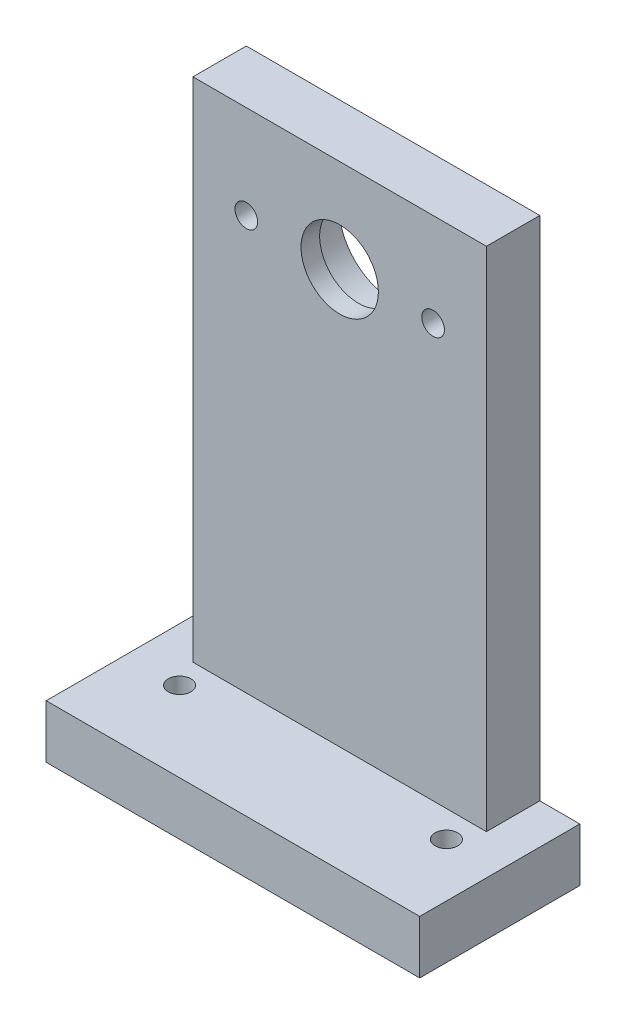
ISO-10303-21;
HEADER;
FILE_DESCRIPTION(('STEP AP214'),'2;1');
FILE_NAME('part.step','',(''),(''),'','','');
FILE_SCHEMA(('AUTOMOTIVE_DESIGN { 1 0 10303 214 1 1 1 1 }'));
ENDSEC;
DATA;
#1=APPLICATION_CONTEXT('core data for automotive mechanical design processes');
#2=APPLICATION_PROTOCOL_DEFINITION('international standard','automotive_design',2000,#1);
#3=PRODUCT_CONTEXT('',#1,'mechanical');
#4=PRODUCT('Part','Part','',(#3));
#5=PRODUCT_RELATED_PRODUCT_CATEGORY('part','',(#4));
#6=PRODUCT_DEFINITION_FORMATION('','',#4);
#7=PRODUCT_DEFINITION_CONTEXT('part definition',#1,'design');
#8=PRODUCT_DEFINITION('design','',#6,#7);
#9=PRODUCT_DEFINITION_SHAPE('','',#8);
#10=(LENGTH_UNIT() NAMED_UNIT(*) SI_UNIT(.MILLI.,.METRE.));
#11=(NAMED_UNIT(*) PLANE_ANGLE_UNIT() SI_UNIT($,.RADIAN.));
#12=(NAMED_UNIT(*) SI_UNIT($,.STERADIAN.) SOLID_ANGLE_UNIT());
#13=UNCERTAINTY_MEASURE_WITH_UNIT(LENGTH_MEASURE(1.E-05),#10,'distance_accuracy_value','');
#14=(GEOMETRIC_REPRESENTATION_CONTEXT(3) GLOBAL_UNCERTAINTY_ASSIGNED_CONTEXT((#13)) GLOBAL_UNIT_ASSIGNED_CONTEXT((#10,
#11,#12)) REPRESENTATION_CONTEXT('',''));
#15=CARTESIAN_POINT('',(0.,0.,0.));
#16=DIRECTION('',(0.,0.,1.));
#17=DIRECTION('',(1.,0.,0.));
#18=AXIS2_PLACEMENT_3D('',#15,#16,#17);
#19=CARTESIAN_POINT('',(0.,0.,0.));
#20=DIRECTION('',(0.,0.,-1.));
#21=DIRECTION('',(-1.,0.,0.));
#22=AXIS2_PLACEMENT_3D('',#19,#20,#21);
#23=PLANE('',#22);
#24=CARTESIAN_POINT('',(0.,70.,0.));
#25=DIRECTION('',(0.,0.,1.));
#26=DIRECTION('',(1.,0.,0.));
#27=AXIS2_PLACEMENT_3D('',#24,#25,#26);
#28=CIRCLE('',#27,8.1);
#29=CARTESIAN_POINT('',(8.1,70.,0.));
#30=VERTEX_POINT('',#29);
#31=EDGE_CURVE('E224',#30,#30,#28,.T.);
#32=ORIENTED_EDGE('',*,*,#31,.T.);
#33=EDGE_LOOP('',(#32));
#34=FACE_BOUND('',#33,.T.);
#35=CARTESIAN_POINT('',(-12.3,70.,0.));
#36=CARTESIAN_POINT('',(-12.299997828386,70.0280353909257,0.));
#37=CARTESIAN_POINT('',(-12.3006681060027,70.0560721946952,0.));
#38=CARTESIAN_POINT('',(-12.3033662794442,70.1118826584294,0.));
#39=CARTESIAN_POINT('',(-12.3053846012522,70.1396567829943,0.));
#40=CARTESIAN_POINT('',(-12.3107783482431,70.1949422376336,0.));
#41=CARTESIAN_POINT('',(-12.3141473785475,70.2224541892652,0.));
#42=CARTESIAN_POINT('',(-12.3222385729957,70.277214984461,0.));
#43=CARTESIAN_POINT('',(-12.3269576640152,70.3044642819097,0.));
#44=CARTESIAN_POINT('',(-12.3377458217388,70.3587000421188,0.));
#45=CARTESIAN_POINT('',(-12.343815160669,70.3856864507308,0.));
#46=CARTESIAN_POINT('',(-12.3573002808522,70.4393970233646,0.));
#47=CARTESIAN_POINT('',(-12.3647196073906,70.4661202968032,0.));
#48=CARTESIAN_POINT('',(-12.3809019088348,70.5193053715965,0.));
#49=CARTESIAN_POINT('',(-12.3896715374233,70.5457651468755,0.));
#50=CARTESIAN_POINT('',(-12.4085496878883,70.5984248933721,0.));
#51=CARTESIAN_POINT('',(-12.4186677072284,70.6246214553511,0.));
#52=CARTESIAN_POINT('',(-12.4401200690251,70.6764495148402,0.));
#53=CARTESIAN_POINT('',(-12.4514518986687,70.7020820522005,0.));
#54=CARTESIAN_POINT('',(-12.4752763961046,70.7525879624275,0.));
#55=CARTESIAN_POINT('',(-12.4877605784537,70.7774653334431,0.));
#56=CARTESIAN_POINT('',(-12.5138850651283,70.8264622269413,0.));
#57=CARTESIAN_POINT('',(-12.5275199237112,70.8505846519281,0.));
#58=CARTESIAN_POINT('',(-12.5559431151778,70.8980726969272,0.));
#59=CARTESIAN_POINT('',(-12.5707290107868,70.9214397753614,0.));
#60=CARTESIAN_POINT('',(-12.6014511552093,70.9674186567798,0.));
#61=CARTESIAN_POINT('',(-12.6173878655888,70.990030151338,0.));
#62=CARTESIAN_POINT('',(-12.6504086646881,71.0344997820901,0.));
#63=CARTESIAN_POINT('',(-12.6674959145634,71.056355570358,0.));
#64=CARTESIAN_POINT('',(-12.7028155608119,71.0993155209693,0.));
#65=CARTESIAN_POINT('',(-12.7210535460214,71.1204150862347,0.));
#66=CARTESIAN_POINT('',(-12.7586706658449,71.1618662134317,0.));
#67=CARTESIAN_POINT('',(-12.7780574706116,71.1822108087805,0.));
#68=CARTESIAN_POINT('',(-12.8177251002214,71.2218978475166,0.));
#69=CARTESIAN_POINT('',(-12.8380033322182,71.2412428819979,0.));
#70=CARTESIAN_POINT('',(-12.8793419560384,71.2787871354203,0.));
#71=CARTESIAN_POINT('',(-12.9003960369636,71.2969932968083,0.));
#72=CARTESIAN_POINT('',(-12.9432822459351,71.3322630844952,0.));
#73=CARTESIAN_POINT('',(-12.9651104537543,71.3493314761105,0.));
#74=CARTESIAN_POINT('',(-13.0095429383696,71.3823276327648,0.));
#75=CARTESIAN_POINT('',(-13.0321455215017,71.3982576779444,0.));
#76=CARTESIAN_POINT('',(-13.0781244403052,71.428979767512,0.));
#77=CARTESIAN_POINT('',(-13.1015010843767,71.4437713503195,0.));
#78=CARTESIAN_POINT('',(-13.1490261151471,71.4722194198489,0.));
#79=CARTESIAN_POINT('',(-13.1731765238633,71.4858725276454,0.));
#80=CARTESIAN_POINT('',(-13.2222476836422,71.5120461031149,0.));
#81=CARTESIAN_POINT('',(-13.2471718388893,71.5245601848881,0.));
#82=CARTESIAN_POINT('',(-13.2977881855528,71.5484605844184,0.));
#83=CARTESIAN_POINT('',(-13.323484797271,71.5598375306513,0.));
#84=CARTESIAN_POINT('',(-13.3753204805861,71.5813234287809,0.));
#85=CARTESIAN_POINT('',(-13.4014581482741,71.5914357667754,0.));
#86=CARTESIAN_POINT('',(-13.4540176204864,71.6103025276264,0.));
#87=CARTESIAN_POINT('',(-13.4804362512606,71.6190657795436,0.));
#88=CARTESIAN_POINT('',(-13.5335551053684,71.6352389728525,0.));
#89=CARTESIAN_POINT('',(-13.5602535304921,71.6426548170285,0.));
#90=CARTESIAN_POINT('',(-13.6139308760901,71.6561357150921,0.));
#91=CARTESIAN_POINT('',(-13.640909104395,71.6622035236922,0.));
#92=CARTESIAN_POINT('',(-13.6951449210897,71.6729916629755,0.));
#93=CARTESIAN_POINT('',(-13.722402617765,71.6777114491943,0.));
#94=CARTESIAN_POINT('',(-13.7771966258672,71.6858069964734,0.));
#95=CARTESIAN_POINT('',(-13.8047335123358,71.6891788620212,0.));
#96=CARTESIAN_POINT('',(-13.8600855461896,71.6945813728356,0.));
#97=CARTESIAN_POINT('',(-13.8879013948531,71.6966048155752,0.));
#98=CARTESIAN_POINT('',(-13.9438110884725,71.6993158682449,0.));
#99=CARTESIAN_POINT('',(-13.9719054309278,71.6999931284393,0.));
#100=CARTESIAN_POINT('',(-14.0280176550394,71.7000068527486,0.));
#101=CARTESIAN_POINT('',(-14.0560355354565,71.6993469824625,0.));
#102=CARTESIAN_POINT('',(-14.1118141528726,71.6966639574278,0.));
#103=CARTESIAN_POINT('',(-14.1395753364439,71.6946501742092,0.));
#104=CARTESIAN_POINT('',(-14.194839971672,71.6892645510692,0.));
#105=CARTESIAN_POINT('',(-14.2223440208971,71.6858988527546,0.));
#106=CARTESIAN_POINT('',(-14.2770943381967,71.6778121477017,0.));
#107=CARTESIAN_POINT('',(-14.304341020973,71.6730939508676,0.));
#108=CARTESIAN_POINT('',(-14.358576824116,71.6623057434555,0.));
#109=CARTESIAN_POINT('',(-14.385565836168,71.6562351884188,0.));
#110=CARTESIAN_POINT('',(-14.4392869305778,71.642745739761,0.));
#111=CARTESIAN_POINT('',(-14.4660180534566,71.6353230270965,0.));
#112=CARTESIAN_POINT('',(-14.5192241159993,71.6191319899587,0.));
#113=CARTESIAN_POINT('',(-14.5456969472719,71.6103567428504,0.));
#114=CARTESIAN_POINT('',(-14.5983882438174,71.591465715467,0.));
#115=CARTESIAN_POINT('',(-14.6246032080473,71.5813401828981,0.));
#116=CARTESIAN_POINT('',(-14.6764493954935,71.5598796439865,0.));
#117=CARTESIAN_POINT('',(-14.7020820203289,71.5485480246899,0.));
#118=CARTESIAN_POINT('',(-14.7525879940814,71.5247236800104,0.));
#119=CARTESIAN_POINT('',(-14.7774653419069,71.5122394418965,0.));
#120=CARTESIAN_POINT('',(-14.8264622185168,71.4861149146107,0.));
#121=CARTESIAN_POINT('',(-14.8505846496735,71.472480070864,0.));
#122=CARTESIAN_POINT('',(-14.8980726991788,71.4440568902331,0.));
#123=CARTESIAN_POINT('',(-14.9214397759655,71.4292709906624,0.));
#124=CARTESIAN_POINT('',(-14.9674186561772,71.398548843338,0.));
#125=CARTESIAN_POINT('',(-14.9900301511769,71.3826121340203,0.));
#126=CARTESIAN_POINT('',(-15.0344997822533,71.3495913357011,0.));
#127=CARTESIAN_POINT('',(-15.0563555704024,71.3325040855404,0.));
#128=CARTESIAN_POINT('',(-15.099315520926,71.2971844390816,0.));
#129=CARTESIAN_POINT('',(-15.1204150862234,71.2789464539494,0.));
#130=CARTESIAN_POINT('',(-15.1618662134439,71.2413293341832,0.));
#131=CARTESIAN_POINT('',(-15.1822108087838,71.2219425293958,0.));
#132=CARTESIAN_POINT('',(-15.221897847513,71.1822748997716,0.));
#133=CARTESIAN_POINT('',(-15.241242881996,71.1619966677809,0.));
#134=CARTESIAN_POINT('',(-15.2787871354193,71.1206580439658,0.));
#135=CARTESIAN_POINT('',(-15.2969932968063,71.0996039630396,0.));
#136=CARTESIAN_POINT('',(-15.3322630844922,71.0567177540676,0.));
#137=CARTESIAN_POINT('',(-15.3493314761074,71.0348895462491,0.));
#138=CARTESIAN_POINT('',(-15.3823276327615,70.9904570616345,0.));
#139=CARTESIAN_POINT('',(-15.398257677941,70.9678544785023,0.));
#140=CARTESIAN_POINT('',(-15.4289797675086,70.9218755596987,0.));
#141=CARTESIAN_POINT('',(-15.4437713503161,70.8984989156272,0.));
#142=CARTESIAN_POINT('',(-15.4722194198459,70.8509738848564,0.));
#143=CARTESIAN_POINT('',(-15.4858725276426,70.82682347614,0.));
#144=CARTESIAN_POINT('',(-15.5120461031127,70.7777523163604,0.));
#145=CARTESIAN_POINT('',(-15.5245601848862,70.7528281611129,0.));
#146=CARTESIAN_POINT('',(-15.5484605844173,70.7022118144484,0.));
#147=CARTESIAN_POINT('',(-15.5598375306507,70.6765152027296,0.));
#148=CARTESIAN_POINT('',(-15.5813234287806,70.6246795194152,0.));
#149=CARTESIAN_POINT('',(-15.5914357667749,70.5985418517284,0.));
#150=CARTESIAN_POINT('',(-15.6103025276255,70.5459823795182,0.));
#151=CARTESIAN_POINT('',(-15.6190657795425,70.5195637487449,0.));
#152=CARTESIAN_POINT('',(-15.6352389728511,70.4664448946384,0.));
#153=CARTESIAN_POINT('',(-15.642654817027,70.4397464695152,0.));
#154=CARTESIAN_POINT('',(-15.6561357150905,70.386069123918,0.));
#155=CARTESIAN_POINT('',(-15.6622035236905,70.3590908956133,0.));
#156=CARTESIAN_POINT('',(-15.6729916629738,70.3048550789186,0.));
#157=CARTESIAN_POINT('',(-15.6777114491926,70.2775973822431,0.));
#158=CARTESIAN_POINT('',(-15.685806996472,70.2228033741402,0.));
#159=CARTESIAN_POINT('',(-15.6891788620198,70.1952664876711,0.));
#160=CARTESIAN_POINT('',(-15.6945813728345,70.1399144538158,0.));
#161=CARTESIAN_POINT('',(-15.6966048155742,70.1120986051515,0.));
#162=CARTESIAN_POINT('',(-15.6993158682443,70.0561889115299,0.));
#163=CARTESIAN_POINT('',(-15.699993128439,70.0280945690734,0.));
#164=CARTESIAN_POINT('',(-15.7000068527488,69.9719823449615,0.));
#165=CARTESIAN_POINT('',(-15.699346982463,69.9439644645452,0.));
#166=CARTESIAN_POINT('',(-15.6966639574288,69.8881858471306,0.));
#167=CARTESIAN_POINT('',(-15.6946501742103,69.86042466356,0.));
#168=CARTESIAN_POINT('',(-15.6892645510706,69.8051600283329,0.));
#169=CARTESIAN_POINT('',(-15.6858988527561,69.7776559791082,0.));
#170=CARTESIAN_POINT('',(-15.6778121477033,69.722905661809,0.));
#171=CARTESIAN_POINT('',(-15.6730939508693,69.6956589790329,0.));
#172=CARTESIAN_POINT('',(-15.6623057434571,69.6414231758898,0.));
#173=CARTESIAN_POINT('',(-15.6562351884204,69.6144341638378,0.));
#174=CARTESIAN_POINT('',(-15.6427457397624,69.5607130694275,0.));
#175=CARTESIAN_POINT('',(-15.6353230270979,69.5339819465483,0.));
#176=CARTESIAN_POINT('',(-15.6191319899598,69.4807758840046,0.));
#177=CARTESIAN_POINT('',(-15.6103567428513,69.4543030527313,0.));
#178=CARTESIAN_POINT('',(-15.5914657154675,69.4016117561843,0.));
#179=CARTESIAN_POINT('',(-15.5813401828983,69.3753967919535,0.));
#180=CARTESIAN_POINT('',(-15.5598796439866,69.3235506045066,0.));
#181=CARTESIAN_POINT('',(-15.5485480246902,69.2979179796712,0.));
#182=CARTESIAN_POINT('',(-15.524723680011,69.2474120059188,0.));
#183=CARTESIAN_POINT('',(-15.5122394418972,69.2225346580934,0.));
#184=CARTESIAN_POINT('',(-15.4861149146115,69.1735377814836,0.));
#185=CARTESIAN_POINT('',(-15.4724800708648,69.1494153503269,0.));
#186=CARTESIAN_POINT('',(-15.4440568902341,69.1019273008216,0.));
#187=CARTESIAN_POINT('',(-15.4292709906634,69.0785602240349,0.));
#188=CARTESIAN_POINT('',(-15.398548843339,69.0325813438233,0.));
#189=CARTESIAN_POINT('',(-15.3826121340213,69.0099698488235,0.));
#190=CARTESIAN_POINT('',(-15.349591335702,68.9655002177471,0.));
#191=CARTESIAN_POINT('',(-15.3325040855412,68.943644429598,0.));
#192=CARTESIAN_POINT('',(-15.2971844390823,68.9006844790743,0.));
#193=CARTESIAN_POINT('',(-15.27894645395,68.8795849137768,0.));
#194=CARTESIAN_POINT('',(-15.2413293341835,68.8381337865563,0.));
#195=CARTESIAN_POINT('',(-15.221942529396,68.8177891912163,0.));
#196=CARTESIAN_POINT('',(-15.182274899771,68.7781021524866,0.));
#197=CARTESIAN_POINT('',(-15.1619966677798,68.758757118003,0.));
#198=CARTESIAN_POINT('',(-15.1206580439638,68.721212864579,0.));
#199=CARTESIAN_POINT('',(-15.0996039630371,68.7030067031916,0.));
#200=CARTESIAN_POINT('',(-15.0567177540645,68.6677369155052,0.));
#201=CARTESIAN_POINT('',(-15.0348895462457,68.6506685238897,0.));
#202=CARTESIAN_POINT('',(-14.9904570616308,68.6176723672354,0.));
#203=CARTESIAN_POINT('',(-14.9678544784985,68.6017423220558,0.));
#204=CARTESIAN_POINT('',(-14.921875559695,68.5710202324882,0.));
#205=CARTESIAN_POINT('',(-14.8984989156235,68.5562286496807,0.));
#206=CARTESIAN_POINT('',(-14.8509738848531,68.5277805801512,0.));
#207=CARTESIAN_POINT('',(-14.8268234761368,68.5141274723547,0.));
#208=CARTESIAN_POINT('',(-14.7777523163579,68.4879538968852,0.));
#209=CARTESIAN_POINT('',(-14.7528281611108,68.475439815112,0.));
#210=CARTESIAN_POINT('',(-14.7022118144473,68.4515394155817,0.));
#211=CARTESIAN_POINT('',(-14.676515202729,68.4401624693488,0.));
#212=CARTESIAN_POINT('',(-14.624679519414,68.4186765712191,0.));
#213=CARTESIAN_POINT('',(-14.598541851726,68.4085642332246,0.));
#214=CARTESIAN_POINT('',(-14.5459823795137,68.3896974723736,0.));
#215=CARTESIAN_POINT('',(-14.5195637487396,68.3809342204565,0.));
#216=CARTESIAN_POINT('',(-14.4664448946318,68.3647610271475,0.));
#217=CARTESIAN_POINT('',(-14.4397464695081,68.3573451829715,0.));
#218=CARTESIAN_POINT('',(-14.3860691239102,68.3438642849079,0.));
#219=CARTESIAN_POINT('',(-14.3590908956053,68.3377964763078,0.));
#220=CARTESIAN_POINT('',(-14.3048550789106,68.3270083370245,0.));
#221=CARTESIAN_POINT('',(-14.2775973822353,68.3222885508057,0.));
#222=CARTESIAN_POINT('',(-14.222803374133,68.3141930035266,0.));
#223=CARTESIAN_POINT('',(-14.1952664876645,68.3108211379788,0.));
#224=CARTESIAN_POINT('',(-14.1399144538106,68.3054186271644,0.));
#225=CARTESIAN_POINT('',(-14.112098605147,68.3033951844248,0.));
#226=CARTESIAN_POINT('',(-14.0561889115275,68.3006841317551,0.));
#227=CARTESIAN_POINT('',(-14.0280945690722,68.3000068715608,0.));
#228=CARTESIAN_POINT('',(-13.9719823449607,68.2999931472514,0.));
#229=CARTESIAN_POINT('',(-13.9439644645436,68.3006530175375,0.));
#230=CARTESIAN_POINT('',(-13.8881858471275,68.3033360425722,0.));
#231=CARTESIAN_POINT('',(-13.8604246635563,68.3053498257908,0.));
#232=CARTESIAN_POINT('',(-13.8051600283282,68.3107354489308,0.));
#233=CARTESIAN_POINT('',(-13.7776559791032,68.3141011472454,0.));
#234=CARTESIAN_POINT('',(-13.7229056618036,68.3221878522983,0.));
#235=CARTESIAN_POINT('',(-13.6956589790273,68.3269060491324,0.));
#236=CARTESIAN_POINT('',(-13.6414231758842,68.3376942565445,0.));
#237=CARTESIAN_POINT('',(-13.6144341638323,68.3437648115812,0.));
#238=CARTESIAN_POINT('',(-13.5607130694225,68.357254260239,0.));
#239=CARTESIAN_POINT('',(-13.5339819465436,68.3646769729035,0.));
#240=CARTESIAN_POINT('',(-13.4807758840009,68.3808680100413,0.));
#241=CARTESIAN_POINT('',(-13.4543030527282,68.3896432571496,0.));
#242=CARTESIAN_POINT('',(-13.4016117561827,68.408534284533,0.));
#243=CARTESIAN_POINT('',(-13.3753967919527,68.4186598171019,0.));
#244=CARTESIAN_POINT('',(-13.3235506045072,68.4401203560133,0.));
#245=CARTESIAN_POINT('',(-13.2979179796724,68.4514519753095,0.));
#246=CARTESIAN_POINT('',(-13.247412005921,68.4752763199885,0.));
#247=CARTESIAN_POINT('',(-13.222534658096,68.4877605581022,0.));
#248=CARTESIAN_POINT('',(-13.1735377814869,68.5138850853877,0.));
#249=CARTESIAN_POINT('',(-13.1494153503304,68.5275199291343,0.));
#250=CARTESIAN_POINT('',(-13.1019273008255,68.555943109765,0.));
#251=CARTESIAN_POINT('',(-13.0785602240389,68.5707290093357,0.));
#252=CARTESIAN_POINT('',(-13.0325813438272,68.6014511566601,0.));
#253=CARTESIAN_POINT('',(-13.0099698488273,68.6173878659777,0.));
#254=CARTESIAN_POINT('',(-12.9655002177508,68.6504086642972,0.));
#255=CARTESIAN_POINT('',(-12.9436444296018,68.6674959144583,0.));
#256=CARTESIAN_POINT('',(-12.9006844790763,68.7028155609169,0.));
#257=CARTESIAN_POINT('',(-12.879584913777,68.7210535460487,0.));
#258=CARTESIAN_POINT('',(-12.8381337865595,68.7586706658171,0.));
#259=CARTESIAN_POINT('',(-12.8177891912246,68.7780574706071,0.));
#260=CARTESIAN_POINT('',(-12.7781021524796,68.8177251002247,0.));
#261=CARTESIAN_POINT('',(-12.7587571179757,68.838003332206,0.));
#262=CARTESIAN_POINT('',(-12.7212128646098,68.8793419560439,0.));
#263=CARTESIAN_POINT('',(-12.7030067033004,68.9003960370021,0.));
#264=CARTESIAN_POINT('',(-12.6677369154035,68.9432822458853,0.));
#265=CARTESIAN_POINT('',(-12.6506685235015,68.965110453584,0.));
#266=CARTESIAN_POINT('',(-12.6176723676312,69.0095429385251,0.));
#267=CARTESIAN_POINT('',(-12.6017423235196,69.0321455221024,0.));
#268=CARTESIAN_POINT('',(-12.5710202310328,69.0781244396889,0.));
#269=CARTESIAN_POINT('',(-12.5562286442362,69.1015010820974,0.));
#270=CARTESIAN_POINT('',(-12.5277805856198,69.1490261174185,0.));
#271=CARTESIAN_POINT('',(-12.5141274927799,69.173176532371,0.));
#272=CARTESIAN_POINT('',(-12.4879538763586,69.222247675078,0.));
#273=CARTESIAN_POINT('',(-12.4754397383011,69.2471718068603,0.));
#274=CARTESIAN_POINT('',(-12.4515394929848,69.2977882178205,0.));
#275=CARTESIAN_POINT('',(-12.4401627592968,69.3234849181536,0.));
#276=CARTESIAN_POINT('',(-12.4186686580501,69.3753387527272,0.));
#277=CARTESIAN_POINT('',(-12.4085487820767,69.4014948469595,0.));
#278=CARTESIAN_POINT('',(-12.3896691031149,69.4540859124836,0.));
#279=CARTESIAN_POINT('',(-12.3809002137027,69.4805176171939,0.));
#280=CARTESIAN_POINT('',(-12.3647182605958,69.53365748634,0.));
#281=CARTESIAN_POINT('',(-12.3572990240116,69.5603637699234,0.));
#282=CARTESIAN_POINT('',(-12.3438137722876,69.6140516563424,0.));
#283=CARTESIAN_POINT('',(-12.3377447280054,69.6410324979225,0.));
#284=CARTESIAN_POINT('',(-12.3269565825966,69.6952683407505,0.));
#285=CARTESIAN_POINT('',(-12.3222377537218,69.7225233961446,0.));
#286=CARTESIAN_POINT('',(-12.3141465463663,69.7773069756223,0.));
#287=CARTESIAN_POINT('',(-12.3107778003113,69.8048360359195,0.));
#288=CARTESIAN_POINT('',(-12.3053840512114,69.8601669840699,0.));
#289=CARTESIAN_POINT('',(-12.3033660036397,69.8879695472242,0.));
#290=CARTESIAN_POINT('',(-12.3006678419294,69.943848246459,0.));
#291=CARTESIAN_POINT('',(-12.2999978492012,69.9719248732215,0.));
#292=CARTESIAN_POINT('',(-12.3,70.,0.));
#293=B_SPLINE_CURVE_WITH_KNOTS('',3,(#35,#36,#37,#38,#39,#40,#41,#42,#43,#44,#45,#46,#47,#48,
#49,#50,#51,#52,#53,#54,#55,#56,#57,#58,#59,#60,#61,#62,#63,#64,#65,#66,#67,#68,#69,#70,#71,#72,
#73,#74,#75,#76,#77,#78,#79,#80,#81,#82,#83,#84,#85,#86,#87,#88,#89,#90,#91,#92,#93,#94,#95,#96,
#97,#98,#99,#100,#101,#102,#103,#104,#105,#106,#107,#108,#109,#110,#111,#112,#113,#114,#115,
#116,#117,#118,#119,#120,#121,#122,#123,#124,#125,#126,#127,#128,#129,#130,#131,#132,#133,#134,
#135,#136,#137,#138,#139,#140,#141,#142,#143,#144,#145,#146,#147,#148,#149,#150,#151,#152,#153,
#154,#155,#156,#157,#158,#159,#160,#161,#162,#163,#164,#165,#166,#167,#168,#169,#170,#171,#172,
#173,#174,#175,#176,#177,#178,#179,#180,#181,#182,#183,#184,#185,#186,#187,#188,#189,#190,#191,
#192,#193,#194,#195,#196,#197,#198,#199,#200,#201,#202,#203,#204,#205,#206,#207,#208,#209,#210,
#211,#212,#213,#214,#215,#216,#217,#218,#219,#220,#221,#222,#223,#224,#225,#226,#227,#228,#229,
#230,#231,#232,#233,#234,#235,#236,#237,#238,#239,#240,#241,#242,#243,#244,#245,#246,#247,#248,
#249,#250,#251,#252,#253,#254,#255,#256,#257,#258,#259,#260,#261,#262,#263,#264,#265,#266,#267,
#268,#269,#270,#271,#272,#273,#274,#275,#276,#277,#278,#279,#280,#281,#282,#283,#284,#285,#286,
#287,#288,#289,#290,#291,#292),.UNSPECIFIED.,.F.,.F.,(4,2,2,2,2,2,2,2,2,2,2,2,2,2,2,2,2,2,2,2,2,
2,2,2,2,2,2,2,2,2,2,2,2,2,2,2,2,2,2,2,2,2,2,2,2,2,2,2,2,2,2,2,2,2,2,2,2,2,2,2,2,2,2,2,2,2,2,2,2,
2,2,2,2,2,2,2,2,2,2,2,2,2,2,2,2,2,2,2,2,2,2,2,2,2,2,2,2,2,2,2,2,2,2,2,2,2,2,2,2,2,2,2,2,2,2,2,2,
2,2,2,2,2,2,2,2,2,2,2,4),(0.,0.084100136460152,0.167609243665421,0.250727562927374,
0.333658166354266,0.41660550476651,0.49977390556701,0.583366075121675,0.66758165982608,
0.751626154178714,0.835094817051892,0.918188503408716,1.00111079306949,1.08406652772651,
1.16726030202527,1.25089496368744,1.33517017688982,1.41921467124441,1.50268333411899,
1.58577702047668,1.66869931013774,1.75165504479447,1.83484881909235,1.91848348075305,
2.00275869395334,2.08680318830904,2.17027185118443,2.2533655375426,2.33628782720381,
2.41924356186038,2.5024373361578,2.58607199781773,2.67034721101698,2.75439170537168,
2.83786036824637,2.92095405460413,3.00387634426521,3.08683207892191,3.1700258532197,
3.25366051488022,3.33793572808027,3.42198022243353,3.50544888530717,3.58854257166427,
3.67146486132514,3.75442059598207,3.83761437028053,3.92124903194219,4.00552424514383,
4.08956873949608,4.17303740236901,4.25613108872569,4.33905337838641,4.42200911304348,
4.50520288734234,4.58883754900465,4.67311276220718,4.75715725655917,4.8406259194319,
4.92371960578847,5.00664189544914,5.08959763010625,5.17279140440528,5.25642606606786,
5.34070127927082,5.42474577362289,5.50821443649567,5.59130812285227,5.67423041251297,
5.75718614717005,5.84037992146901,5.92401458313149,6.00828979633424,6.09233429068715,
6.17580295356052,6.25889663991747,6.34181892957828,6.42477466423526,6.50796843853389,
6.59160310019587,6.67587831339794,6.7599228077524,6.8433914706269,6.92648515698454,
7.00940744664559,7.09236318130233,7.17555695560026,7.25919161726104,7.34346683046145,
7.42751132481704,7.51097998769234,7.59407367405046,7.67699596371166,7.75995169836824,
7.84314547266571,7.92678013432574,8.01105534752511,8.09509984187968,8.17856850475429,
8.26166219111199,8.34458448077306,8.42754021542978,8.51073398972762,8.59436865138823,
8.67864386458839,8.7626883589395,8.8461570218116,8.9292507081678,9.01217299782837,
9.09512873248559,9.17832250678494,9.26195716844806,9.34623238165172,9.43027687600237,
9.51374553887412,9.5968392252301,9.67976151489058,9.76271724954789,9.84591102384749,
9.92954568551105,10.0138208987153,10.0979251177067,10.1814363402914,10.2645554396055,
10.3474861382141,10.4304335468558,10.5136026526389,10.5971968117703,10.6814163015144),.UNSPECIFIED.);
#294=CARTESIAN_POINT('',(-12.3,70.,0.));
#295=VERTEX_POINT('',#294);
#296=EDGE_CURVE('E174',#295,#295,#293,.T.);
#297=ORIENTED_EDGE('',*,*,#296,.T.);
#298=EDGE_LOOP('',(#297));
#299=FACE_BOUND('',#298,.T.);
#300=DIRECTION('',(0.,1.,0.));
#301=VECTOR('',#300,1.);
#302=CARTESIAN_POINT('',(28.,0.,0.));
#303=LINE('',#302,#301);
#304=CARTESIAN_POINT('',(28.,0.,0.));
#305=VERTEX_POINT('',#304);
#306=CARTESIAN_POINT('',(28.,8.,0.));
#307=VERTEX_POINT('',#306);
#308=EDGE_CURVE('E155',#305,#307,#303,.T.);
#309=ORIENTED_EDGE('',*,*,#308,.F.);
#310=DIRECTION('',(1.,0.,0.));
#311=VECTOR('',#310,1.);
#312=CARTESIAN_POINT('',(-28.,0.,0.));
#313=LINE('',#312,#311);
#314=CARTESIAN_POINT('',(-28.,0.,0.));
#315=VERTEX_POINT('',#314);
#316=EDGE_CURVE('E147',#315,#305,#313,.T.);
#317=ORIENTED_EDGE('',*,*,#316,.F.);
#318=DIRECTION('',(0.,-1.,0.));
#319=VECTOR('',#318,1.);
#320=CARTESIAN_POINT('',(-28.,0.,0.));
#321=LINE('',#320,#319);
#322=CARTESIAN_POINT('',(-28.,8.,0.));
#323=VERTEX_POINT('',#322);
#324=EDGE_CURVE('E120',#323,#315,#321,.T.);
#325=ORIENTED_EDGE('',*,*,#324,.F.);
#326=DIRECTION('',(-1.,0.,0.));
#327=VECTOR('',#326,1.);
#328=CARTESIAN_POINT('',(-28.,8.,0.));
#329=LINE('',#328,#327);
#330=CARTESIAN_POINT('',(-22.,8.,0.));
#331=VERTEX_POINT('',#330);
#332=EDGE_CURVE('E152',#331,#323,#329,.T.);
#333=ORIENTED_EDGE('',*,*,#332,.F.);
#334=DIRECTION('',(0.,-1.,0.));
#335=VECTOR('',#334,1.);
#336=CARTESIAN_POINT('',(-22.,0.,0.));
#337=LINE('',#336,#335);
#338=CARTESIAN_POINT('',(-22.,84.,0.));
#339=VERTEX_POINT('',#338);
#340=EDGE_CURVE('E128',#339,#331,#337,.T.);
#341=ORIENTED_EDGE('',*,*,#340,.F.);
#342=DIRECTION('',(-1.,0.,0.));
#343=VECTOR('',#342,1.);
#344=CARTESIAN_POINT('',(-22.,84.,0.));
#345=LINE('',#344,#343);
#346=CARTESIAN_POINT('',(22.,84.,0.));
#347=VERTEX_POINT('',#346);
#348=EDGE_CURVE('E135',#347,#339,#345,.T.);
#349=ORIENTED_EDGE('',*,*,#348,.F.);
#350=DIRECTION('',(0.,1.,0.));
#351=VECTOR('',#350,1.);
#352=CARTESIAN_POINT('',(22.,0.,0.));
#353=LINE('',#352,#351);
#354=CARTESIAN_POINT('',(22.,8.,0.));
#355=VERTEX_POINT('',#354);
#356=EDGE_CURVE('E117',#355,#347,#353,.T.);
#357=ORIENTED_EDGE('',*,*,#356,.F.);
#358=EDGE_CURVE('E143',#307,#355,#329,.T.);
#359=ORIENTED_EDGE('',*,*,#358,.F.);
#360=EDGE_LOOP('',(#309,#317,#325,#333,#341,#349,#357,#359));
#361=FACE_BOUND('',#360,.T.);
#362=CARTESIAN_POINT('',(15.7,70.,0.));
#363=CARTESIAN_POINT('',(15.700002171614,70.0280353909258,0.));
#364=CARTESIAN_POINT('',(15.6993318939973,70.0560721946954,0.));
#365=CARTESIAN_POINT('',(15.6966337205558,70.1118826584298,0.));
#366=CARTESIAN_POINT('',(15.6946153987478,70.1396567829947,0.));
#367=CARTESIAN_POINT('',(15.6892216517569,70.1949422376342,0.));
#368=CARTESIAN_POINT('',(15.6858526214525,70.2224541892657,0.));
#369=CARTESIAN_POINT('',(15.6777614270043,70.2772149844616,0.));
#370=CARTESIAN_POINT('',(15.6730423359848,70.3044642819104,0.));
#371=CARTESIAN_POINT('',(15.6622541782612,70.3587000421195,0.));
#372=CARTESIAN_POINT('',(15.656184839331,70.3856864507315,0.));
#373=CARTESIAN_POINT('',(15.6426997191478,70.4393970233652,0.));
#374=CARTESIAN_POINT('',(15.6352803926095,70.4661202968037,0.));
#375=CARTESIAN_POINT('',(15.6190980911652,70.5193053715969,0.));
#376=CARTESIAN_POINT('',(15.6103284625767,70.5457651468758,0.));
#377=CARTESIAN_POINT('',(15.5914503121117,70.5984248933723,0.));
#378=CARTESIAN_POINT('',(15.5813322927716,70.6246214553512,0.));
#379=CARTESIAN_POINT('',(15.5598799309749,70.6764495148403,0.));
#380=CARTESIAN_POINT('',(15.5485481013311,70.7020820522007,0.));
#381=CARTESIAN_POINT('',(15.5247236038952,70.7525879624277,0.));
#382=CARTESIAN_POINT('',(15.512239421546,70.7774653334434,0.));
#383=CARTESIAN_POINT('',(15.4861149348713,70.8264622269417,0.));
#384=CARTESIAN_POINT('',(15.4724800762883,70.8505846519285,0.));
#385=CARTESIAN_POINT('',(15.4440568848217,70.8980726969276,0.));
#386=CARTESIAN_POINT('',(15.4292709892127,70.9214397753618,0.));
#387=CARTESIAN_POINT('',(15.3985488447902,70.9674186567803,0.));
#388=CARTESIAN_POINT('',(15.3826121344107,70.9900301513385,0.));
#389=CARTESIAN_POINT('',(15.3495913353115,71.0344997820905,0.));
#390=CARTESIAN_POINT('',(15.3325040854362,71.0563555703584,0.));
#391=CARTESIAN_POINT('',(15.2971844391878,71.0993155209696,0.));
#392=CARTESIAN_POINT('',(15.2789464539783,71.120415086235,0.));
#393=CARTESIAN_POINT('',(15.2413293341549,71.1618662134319,0.));
#394=CARTESIAN_POINT('',(15.2219425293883,71.1822108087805,0.));
#395=CARTESIAN_POINT('',(15.1822748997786,71.2218978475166,0.));
#396=CARTESIAN_POINT('',(15.1619966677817,71.2412428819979,0.));
#397=CARTESIAN_POINT('',(15.1206580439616,71.2787871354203,0.));
#398=CARTESIAN_POINT('',(15.0996039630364,71.2969932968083,0.));
#399=CARTESIAN_POINT('',(15.0567177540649,71.3322630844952,0.));
#400=CARTESIAN_POINT('',(15.0348895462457,71.3493314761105,0.));
#401=CARTESIAN_POINT('',(14.9904570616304,71.3823276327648,0.));
#402=CARTESIAN_POINT('',(14.9678544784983,71.3982576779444,0.));
#403=CARTESIAN_POINT('',(14.9218755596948,71.428979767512,0.));
#404=CARTESIAN_POINT('',(14.8984989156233,71.4437713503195,0.));
#405=CARTESIAN_POINT('',(14.8509738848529,71.4722194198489,0.));
#406=CARTESIAN_POINT('',(14.8268234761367,71.4858725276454,0.));
#407=CARTESIAN_POINT('',(14.7777523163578,71.5120461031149,0.));
#408=CARTESIAN_POINT('',(14.7528281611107,71.5245601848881,0.));
#409=CARTESIAN_POINT('',(14.7022118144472,71.5484605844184,0.));
#410=CARTESIAN_POINT('',(14.676515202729,71.5598375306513,0.));
#411=CARTESIAN_POINT('',(14.6246795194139,71.5813234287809,0.));
#412=CARTESIAN_POINT('',(14.5985418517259,71.5914357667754,0.));
#413=CARTESIAN_POINT('',(14.5459823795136,71.6103025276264,0.));
#414=CARTESIAN_POINT('',(14.5195637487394,71.6190657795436,0.));
#415=CARTESIAN_POINT('',(14.4664448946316,71.6352389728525,0.));
#416=CARTESIAN_POINT('',(14.4397464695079,71.6426548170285,0.));
#417=CARTESIAN_POINT('',(14.3860691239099,71.6561357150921,0.));
#418=CARTESIAN_POINT('',(14.359090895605,71.6622035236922,0.));
#419=CARTESIAN_POINT('',(14.3048550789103,71.6729916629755,0.));
#420=CARTESIAN_POINT('',(14.277597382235,71.6777114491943,0.));
#421=CARTESIAN_POINT('',(14.2228033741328,71.6858069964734,0.));
#422=CARTESIAN_POINT('',(14.1952664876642,71.6891788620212,0.));
#423=CARTESIAN_POINT('',(14.1399144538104,71.6945813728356,0.));
#424=CARTESIAN_POINT('',(14.1120986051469,71.6966048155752,0.));
#425=CARTESIAN_POINT('',(14.0561889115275,71.6993158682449,0.));
#426=CARTESIAN_POINT('',(14.0280945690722,71.6999931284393,0.));
#427=CARTESIAN_POINT('',(13.9719823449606,71.7000068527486,0.));
#428=CARTESIAN_POINT('',(13.9439644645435,71.6993469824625,0.));
#429=CARTESIAN_POINT('',(13.8881858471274,71.6966639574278,0.));
#430=CARTESIAN_POINT('',(13.8604246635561,71.6946501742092,0.));
#431=CARTESIAN_POINT('',(13.805160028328,71.6892645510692,0.));
#432=CARTESIAN_POINT('',(13.7776559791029,71.6858988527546,0.));
#433=CARTESIAN_POINT('',(13.7229056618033,71.6778121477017,0.));
#434=CARTESIAN_POINT('',(13.695658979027,71.6730939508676,0.));
#435=CARTESIAN_POINT('',(13.641423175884,71.6623057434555,0.));
#436=CARTESIAN_POINT('',(13.614434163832,71.6562351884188,0.));
#437=CARTESIAN_POINT('',(13.5607130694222,71.642745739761,0.));
#438=CARTESIAN_POINT('',(13.5339819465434,71.6353230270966,0.));
#439=CARTESIAN_POINT('',(13.4807758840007,71.6191319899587,0.));
#440=CARTESIAN_POINT('',(13.4543030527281,71.6103567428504,0.));
#441=CARTESIAN_POINT('',(13.4016117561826,71.591465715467,0.));
#442=CARTESIAN_POINT('',(13.3753967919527,71.5813401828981,0.));
#443=CARTESIAN_POINT('',(13.3235506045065,71.5598796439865,0.));
#444=CARTESIAN_POINT('',(13.2979179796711,71.5485480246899,0.));
#445=CARTESIAN_POINT('',(13.2474120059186,71.5247236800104,0.));
#446=CARTESIAN_POINT('',(13.2225346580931,71.5122394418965,0.));
#447=CARTESIAN_POINT('',(13.1735377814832,71.4861149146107,0.));
#448=CARTESIAN_POINT('',(13.1494153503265,71.472480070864,0.));
#449=CARTESIAN_POINT('',(13.1019273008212,71.4440568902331,0.));
#450=CARTESIAN_POINT('',(13.0785602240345,71.4292709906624,0.));
#451=CARTESIAN_POINT('',(13.0325813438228,71.398548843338,0.));
#452=CARTESIAN_POINT('',(13.0099698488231,71.3826121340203,0.));
#453=CARTESIAN_POINT('',(12.9655002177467,71.3495913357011,0.));
#454=CARTESIAN_POINT('',(12.9436444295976,71.3325040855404,0.));
#455=CARTESIAN_POINT('',(12.900684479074,71.2971844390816,0.));
#456=CARTESIAN_POINT('',(12.8795849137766,71.2789464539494,0.));
#457=CARTESIAN_POINT('',(12.8381337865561,71.2413293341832,0.));
#458=CARTESIAN_POINT('',(12.8177891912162,71.2219425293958,0.));
#459=CARTESIAN_POINT('',(12.7781021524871,71.1822748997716,0.));
#460=CARTESIAN_POINT('',(12.758757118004,71.1619966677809,0.));
#461=CARTESIAN_POINT('',(12.7212128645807,71.1206580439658,0.));
#462=CARTESIAN_POINT('',(12.7030067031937,71.0996039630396,0.));
#463=CARTESIAN_POINT('',(12.6677369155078,71.0567177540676,0.));
#464=CARTESIAN_POINT('',(12.6506685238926,71.0348895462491,0.));
#465=CARTESIAN_POINT('',(12.6176723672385,70.9904570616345,0.));
#466=CARTESIAN_POINT('',(12.601742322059,70.9678544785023,0.));
#467=CARTESIAN_POINT('',(12.5710202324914,70.9218755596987,0.));
#468=CARTESIAN_POINT('',(12.5562286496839,70.8984989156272,0.));
#469=CARTESIAN_POINT('',(12.5277805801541,70.8509738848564,0.));
#470=CARTESIAN_POINT('',(12.5141274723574,70.82682347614,0.));
#471=CARTESIAN_POINT('',(12.4879538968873,70.7777523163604,0.));
#472=CARTESIAN_POINT('',(12.4754398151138,70.7528281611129,0.));
#473=CARTESIAN_POINT('',(12.4515394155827,70.7022118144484,0.));
#474=CARTESIAN_POINT('',(12.4401624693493,70.6765152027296,0.));
#475=CARTESIAN_POINT('',(12.4186765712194,70.6246795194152,0.));
#476=CARTESIAN_POINT('',(12.4085642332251,70.5985418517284,0.));
#477=CARTESIAN_POINT('',(12.3896974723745,70.5459823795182,0.));
#478=CARTESIAN_POINT('',(12.3809342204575,70.5195637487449,0.));
#479=CARTESIAN_POINT('',(12.3647610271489,70.4664448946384,0.));
#480=CARTESIAN_POINT('',(12.357345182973,70.4397464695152,0.));
#481=CARTESIAN_POINT('',(12.3438642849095,70.386069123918,0.));
#482=CARTESIAN_POINT('',(12.3377964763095,70.3590908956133,0.));
#483=CARTESIAN_POINT('',(12.3270083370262,70.3048550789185,0.));
#484=CARTESIAN_POINT('',(12.3222885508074,70.2775973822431,0.));
#485=CARTESIAN_POINT('',(12.314193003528,70.2228033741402,0.));
#486=CARTESIAN_POINT('',(12.3108211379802,70.1952664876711,0.));
#487=CARTESIAN_POINT('',(12.3054186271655,70.1399144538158,0.));
#488=CARTESIAN_POINT('',(12.3033951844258,70.1120986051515,0.));
#489=CARTESIAN_POINT('',(12.3006841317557,70.0561889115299,0.));
#490=CARTESIAN_POINT('',(12.300006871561,70.0280945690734,0.));
#491=CARTESIAN_POINT('',(12.2999931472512,69.9719823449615,0.));
#492=CARTESIAN_POINT('',(12.300653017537,69.9439644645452,0.));
#493=CARTESIAN_POINT('',(12.3033360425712,69.8881858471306,0.));
#494=CARTESIAN_POINT('',(12.3053498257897,69.86042466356,0.));
#495=CARTESIAN_POINT('',(12.3107354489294,69.8051600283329,0.));
#496=CARTESIAN_POINT('',(12.314101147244,69.7776559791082,0.));
#497=CARTESIAN_POINT('',(12.3221878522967,69.722905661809,0.));
#498=CARTESIAN_POINT('',(12.3269060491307,69.6956589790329,0.));
#499=CARTESIAN_POINT('',(12.3376942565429,69.6414231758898,0.));
#500=CARTESIAN_POINT('',(12.3437648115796,69.6144341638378,0.));
#501=CARTESIAN_POINT('',(12.3572542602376,69.5607130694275,0.));
#502=CARTESIAN_POINT('',(12.3646769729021,69.5339819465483,0.));
#503=CARTESIAN_POINT('',(12.3808680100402,69.4807758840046,0.));
#504=CARTESIAN_POINT('',(12.3896432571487,69.4543030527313,0.));
#505=CARTESIAN_POINT('',(12.4085342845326,69.4016117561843,0.));
#506=CARTESIAN_POINT('',(12.4186598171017,69.3753967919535,0.));
#507=CARTESIAN_POINT('',(12.4401203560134,69.3235506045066,0.));
#508=CARTESIAN_POINT('',(12.4514519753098,69.2979179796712,0.));
#509=CARTESIAN_POINT('',(12.475276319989,69.2474120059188,0.));
#510=CARTESIAN_POINT('',(12.4877605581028,69.2225346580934,0.));
#511=CARTESIAN_POINT('',(12.5138850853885,69.1735377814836,0.));
#512=CARTESIAN_POINT('',(12.5275199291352,69.1494153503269,0.));
#513=CARTESIAN_POINT('',(12.5559431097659,69.1019273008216,0.));
#514=CARTESIAN_POINT('',(12.5707290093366,69.0785602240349,0.));
#515=CARTESIAN_POINT('',(12.6014511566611,69.0325813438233,0.));
#516=CARTESIAN_POINT('',(12.6173878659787,69.0099698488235,0.));
#517=CARTESIAN_POINT('',(12.650408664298,68.9655002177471,0.));
#518=CARTESIAN_POINT('',(12.6674959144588,68.943644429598,0.));
#519=CARTESIAN_POINT('',(12.7028155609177,68.9006844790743,0.));
#520=CARTESIAN_POINT('',(12.72105354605,68.8795849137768,0.));
#521=CARTESIAN_POINT('',(12.7586706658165,68.8381337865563,0.));
#522=CARTESIAN_POINT('',(12.778057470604,68.8177891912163,0.));
#523=CARTESIAN_POINT('',(12.817725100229,68.7781021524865,0.));
#524=CARTESIAN_POINT('',(12.8380033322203,68.758757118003,0.));
#525=CARTESIAN_POINT('',(12.8793419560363,68.7212128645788,0.));
#526=CARTESIAN_POINT('',(12.900396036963,68.7030067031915,0.));
#527=CARTESIAN_POINT('',(12.9432822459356,68.667736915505,0.));
#528=CARTESIAN_POINT('',(12.9651104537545,68.6506685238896,0.));
#529=CARTESIAN_POINT('',(13.0095429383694,68.6176723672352,0.));
#530=CARTESIAN_POINT('',(13.0321455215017,68.6017423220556,0.));
#531=CARTESIAN_POINT('',(13.0781244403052,68.571020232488,0.));
#532=CARTESIAN_POINT('',(13.1015010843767,68.5562286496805,0.));
#533=CARTESIAN_POINT('',(13.1490261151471,68.5277805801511,0.));
#534=CARTESIAN_POINT('',(13.1731765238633,68.5141274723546,0.));
#535=CARTESIAN_POINT('',(13.2222476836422,68.4879538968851,0.));
#536=CARTESIAN_POINT('',(13.2471718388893,68.4754398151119,0.));
#537=CARTESIAN_POINT('',(13.2977881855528,68.4515394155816,0.));
#538=CARTESIAN_POINT('',(13.323484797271,68.4401624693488,0.));
#539=CARTESIAN_POINT('',(13.3753204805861,68.4186765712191,0.));
#540=CARTESIAN_POINT('',(13.4014581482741,68.4085642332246,0.));
#541=CARTESIAN_POINT('',(13.4540176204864,68.3896974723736,0.));
#542=CARTESIAN_POINT('',(13.4804362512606,68.3809342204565,0.));
#543=CARTESIAN_POINT('',(13.5335551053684,68.3647610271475,0.));
#544=CARTESIAN_POINT('',(13.5602535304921,68.3573451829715,0.));
#545=CARTESIAN_POINT('',(13.6139308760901,68.3438642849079,0.));
#546=CARTESIAN_POINT('',(13.640909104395,68.3377964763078,0.));
#547=CARTESIAN_POINT('',(13.6951449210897,68.3270083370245,0.));
#548=CARTESIAN_POINT('',(13.722402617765,68.3222885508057,0.));
#549=CARTESIAN_POINT('',(13.7771966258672,68.3141930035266,0.));
#550=CARTESIAN_POINT('',(13.8047335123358,68.3108211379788,0.));
#551=CARTESIAN_POINT('',(13.8600855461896,68.3054186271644,0.));
#552=CARTESIAN_POINT('',(13.8879013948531,68.3033951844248,0.));
#553=CARTESIAN_POINT('',(13.9438110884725,68.3006841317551,0.));
#554=CARTESIAN_POINT('',(13.9719054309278,68.3000068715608,0.));
#555=CARTESIAN_POINT('',(14.0280176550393,68.2999931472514,0.));
#556=CARTESIAN_POINT('',(14.0560355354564,68.3006530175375,0.));
#557=CARTESIAN_POINT('',(14.1118141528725,68.3033360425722,0.));
#558=CARTESIAN_POINT('',(14.1395753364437,68.3053498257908,0.));
#559=CARTESIAN_POINT('',(14.1948399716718,68.3107354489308,0.));
#560=CARTESIAN_POINT('',(14.2223440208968,68.3141011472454,0.));
#561=CARTESIAN_POINT('',(14.2770943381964,68.3221878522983,0.));
#562=CARTESIAN_POINT('',(14.3043410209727,68.3269060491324,0.));
#563=CARTESIAN_POINT('',(14.3585768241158,68.3376942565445,0.));
#564=CARTESIAN_POINT('',(14.3855658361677,68.3437648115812,0.));
#565=CARTESIAN_POINT('',(14.4392869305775,68.357254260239,0.));
#566=CARTESIAN_POINT('',(14.4660180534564,68.3646769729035,0.));
#567=CARTESIAN_POINT('',(14.5192241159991,68.3808680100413,0.));
#568=CARTESIAN_POINT('',(14.5456969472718,68.3896432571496,0.));
#569=CARTESIAN_POINT('',(14.5983882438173,68.408534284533,0.));
#570=CARTESIAN_POINT('',(14.6246032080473,68.4186598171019,0.));
#571=CARTESIAN_POINT('',(14.6764493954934,68.4401203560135,0.));
#572=CARTESIAN_POINT('',(14.7020820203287,68.45145197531,0.));
#573=CARTESIAN_POINT('',(14.7525879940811,68.4752763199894,0.));
#574=CARTESIAN_POINT('',(14.7774653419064,68.4877605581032,0.));
#575=CARTESIAN_POINT('',(14.8264622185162,68.513885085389,0.));
#576=CARTESIAN_POINT('',(14.8505846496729,68.5275199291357,0.));
#577=CARTESIAN_POINT('',(14.8980726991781,68.5559431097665,0.));
#578=CARTESIAN_POINT('',(14.9214397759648,68.5707290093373,0.));
#579=CARTESIAN_POINT('',(14.9674186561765,68.6014511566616,0.));
#580=CARTESIAN_POINT('',(14.9900301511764,68.6173878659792,0.));
#581=CARTESIAN_POINT('',(15.0344997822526,68.6504086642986,0.));
#582=CARTESIAN_POINT('',(15.0563555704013,68.6674959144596,0.));
#583=CARTESIAN_POINT('',(15.0993155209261,68.7028155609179,0.));
#584=CARTESIAN_POINT('',(15.1204150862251,68.7210535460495,0.));
#585=CARTESIAN_POINT('',(15.1618662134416,68.7586706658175,0.));
#586=CARTESIAN_POINT('',(15.182210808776,68.7780574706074,0.));
#587=CARTESIAN_POINT('',(15.2218978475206,68.8177251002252,0.));
#588=CARTESIAN_POINT('',(15.2412428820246,68.8380033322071,0.));
#589=CARTESIAN_POINT('',(15.2787871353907,68.8793419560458,0.));
#590=CARTESIAN_POINT('',(15.2969932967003,68.9003960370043,0.));
#591=CARTESIAN_POINT('',(15.3322630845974,68.9432822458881,0.));
#592=CARTESIAN_POINT('',(15.3493314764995,68.965110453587,0.));
#593=CARTESIAN_POINT('',(15.3823276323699,69.0095429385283,0.));
#594=CARTESIAN_POINT('',(15.3982576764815,69.0321455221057,0.));
#595=CARTESIAN_POINT('',(15.4289797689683,69.0781244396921,0.));
#596=CARTESIAN_POINT('',(15.4437713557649,69.1015010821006,0.));
#597=CARTESIAN_POINT('',(15.4722194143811,69.1490261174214,0.));
#598=CARTESIAN_POINT('',(15.485872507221,69.1731765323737,0.));
#599=CARTESIAN_POINT('',(15.5120461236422,69.2222476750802,0.));
#600=CARTESIAN_POINT('',(15.5245602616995,69.2471718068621,0.));
#601=CARTESIAN_POINT('',(15.5484605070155,69.2977882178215,0.));
#602=CARTESIAN_POINT('',(15.5598372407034,69.3234849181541,0.));
#603=CARTESIAN_POINT('',(15.5813313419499,69.3753387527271,0.));
#604=CARTESIAN_POINT('',(15.5914512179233,69.4014948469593,0.));
#605=CARTESIAN_POINT('',(15.6103308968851,69.4540859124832,0.));
#606=CARTESIAN_POINT('',(15.6190997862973,69.4805176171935,0.));
#607=CARTESIAN_POINT('',(15.6352817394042,69.5336574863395,0.));
#608=CARTESIAN_POINT('',(15.6427009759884,69.5603637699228,0.));
#609=CARTESIAN_POINT('',(15.6561862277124,69.6140516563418,0.));
#610=CARTESIAN_POINT('',(15.6622552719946,69.6410324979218,0.));
#611=CARTESIAN_POINT('',(15.6730434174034,69.6952683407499,0.));
#612=CARTESIAN_POINT('',(15.6777622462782,69.7225233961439,0.));
#613=CARTESIAN_POINT('',(15.6858534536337,69.7773069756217,0.));
#614=CARTESIAN_POINT('',(15.6892221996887,69.8048360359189,0.));
#615=CARTESIAN_POINT('',(15.6946159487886,69.8601669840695,0.));
#616=CARTESIAN_POINT('',(15.6966339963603,69.8879695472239,0.));
#617=CARTESIAN_POINT('',(15.6993321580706,69.9438482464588,0.));
#618=CARTESIAN_POINT('',(15.7000021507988,69.9719248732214,0.));
#619=CARTESIAN_POINT('',(15.7,70.,0.));
#620=B_SPLINE_CURVE_WITH_KNOTS('',3,(#362,#363,#364,#365,#366,#367,#368,#369,#370,#371,#372,
#373,#374,#375,#376,#377,#378,#379,#380,#381,#382,#383,#384,#385,#386,#387,#388,#389,#390,#391,
#392,#393,#394,#395,#396,#397,#398,#399,#400,#401,#402,#403,#404,#405,#406,#407,#408,#409,#410,
#411,#412,#413,#414,#415,#416,#417,#418,#419,#420,#421,#422,#423,#424,#425,#426,#427,#428,#429,
#430,#431,#432,#433,#434,#435,#436,#437,#438,#439,#440,#441,#442,#443,#444,#445,#446,#447,#448,
#449,#450,#451,#452,#453,#454,#455,#456,#457,#458,#459,#460,#461,#462,#463,#464,#465,#466,#467,
#468,#469,#470,#471,#472,#473,#474,#475,#476,#477,#478,#479,#480,#481,#482,#483,#484,#485,#486,
#487,#488,#489,#490,#491,#492,#493,#494,#495,#496,#497,#498,#499,#500,#501,#502,#503,#504,#505,
#506,#507,#508,#509,#510,#511,#512,#513,#514,#515,#516,#517,#518,#519,#520,#521,#522,#523,#524,
#525,#526,#527,#528,#529,#530,#531,#532,#533,#534,#535,#536,#537,#538,#539,#540,#541,#542,#543,
#544,#545,#546,#547,#548,#549,#550,#551,#552,#553,#554,#555,#556,#557,#558,#559,#560,#561,#562,
#563,#564,#565,#566,#567,#568,#569,#570,#571,#572,#573,#574,#575,#576,#577,#578,#579,#580,#581,
#582,#583,#584,#585,#586,#587,#588,#589,#590,#591,#592,#593,#594,#595,#596,#597,#598,#599,#600,
#601,#602,#603,#604,#605,#606,#607,#608,#609,#610,#611,#612,#613,#614,#615,#616,#617,#618,#619),
.UNSPECIFIED.,.F.,.F.,(4,2,2,2,2,2,2,2,2,2,2,2,2,2,2,2,2,2,2,2,2,2,2,2,2,2,2,2,2,2,2,2,2,2,2,2,
2,2,2,2,2,2,2,2,2,2,2,2,2,2,2,2,2,2,2,2,2,2,2,2,2,2,2,2,2,2,2,2,2,2,2,2,2,2,2,2,2,2,2,2,2,2,2,2,
2,2,2,2,2,2,2,2,2,2,2,2,2,2,2,2,2,2,2,2,2,2,2,2,2,2,2,2,2,2,2,2,2,2,2,2,2,2,2,2,2,2,2,2,4),(0.,
0.0841001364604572,0.167609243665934,0.250727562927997,0.333658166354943,0.416605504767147,
0.499773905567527,0.583366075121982,0.667581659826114,0.751626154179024,0.835094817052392,
0.918188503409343,1.00111079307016,1.08406652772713,1.16726030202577,1.25089496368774,
1.33517017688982,1.41921467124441,1.50268333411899,1.58577702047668,1.66869931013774,
1.75165504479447,1.83484881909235,1.91848348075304,2.00275869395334,2.08680318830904,
2.17027185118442,2.25336553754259,2.33628782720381,2.41924356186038,2.5024373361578,
2.58607199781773,2.67034721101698,2.75439170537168,2.83786036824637,2.92095405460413,
3.00387634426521,3.08683207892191,3.1700258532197,3.25366051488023,3.33793572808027,
3.42198022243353,3.50544888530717,3.58854257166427,3.67146486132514,3.75442059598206,
3.83761437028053,3.92124903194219,4.00552424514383,4.08956873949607,4.173037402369,
4.25613108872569,4.33905337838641,4.42200911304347,4.50520288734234,4.58883754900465,
4.67311276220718,4.75715725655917,4.8406259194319,4.92371960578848,5.00664189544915,
5.08959763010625,5.17279140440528,5.25642606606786,5.34070127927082,5.42474577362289,
5.50821443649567,5.59130812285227,5.67423041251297,5.75718614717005,5.84037992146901,
5.92401458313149,6.00828979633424,6.09233429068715,6.17580295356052,6.25889663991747,
6.34181892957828,6.42477466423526,6.50796843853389,6.59160310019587,6.67587831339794,
6.75992280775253,6.84339147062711,6.9264851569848,7.00940744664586,7.09236318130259,
7.17555695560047,7.25919161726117,7.34346683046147,7.42751132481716,7.51097998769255,
7.59407367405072,7.67699596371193,7.7599516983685,7.84314547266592,7.92678013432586,
8.0110553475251,8.09509984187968,8.17856850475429,8.26166219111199,8.34458448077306,
8.42754021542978,8.51073398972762,8.59436865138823,8.67864386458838,8.7626883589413,
8.84615702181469,8.92925070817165,9.01217299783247,9.09512873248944,9.17832250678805,
9.26195716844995,9.34623238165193,9.43027687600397,9.51374553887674,9.59683922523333,
9.67976151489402,9.76271724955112,9.84591102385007,9.92954568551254,10.0138208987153,
10.0979251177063,10.1814363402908,10.2645554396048,10.3474861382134,10.4304335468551,
10.5136026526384,10.59719681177,10.6814163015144),.UNSPECIFIED.);
#621=CARTESIAN_POINT('',(15.7,70.,0.));
#622=VERTEX_POINT('',#621);
#623=EDGE_CURVE('E212',#622,#622,#620,.T.);
#624=ORIENTED_EDGE('',*,*,#623,.T.);
#625=EDGE_LOOP('',(#624));
#626=FACE_BOUND('',#625,.T.);
#627=ADVANCED_FACE('F39',(#34,#299,#361,#626),#23,.T.);
#628=CARTESIAN_POINT('',(-28.,8.,24.));
#629=DIRECTION('',(0.,-1.,0.));
#630=DIRECTION('',(0.,0.,-1.));
#631=AXIS2_PLACEMENT_3D('',#628,#629,#630);
#632=PLANE('',#631);
#633=CARTESIAN_POINT('',(-20.,8.,12.));
#634=DIRECTION('',(0.,-1.,0.));
#635=DIRECTION('',(0.,0.,-1.));
#636=AXIS2_PLACEMENT_3D('',#633,#634,#635);
#637=CIRCLE('',#636,1.7);
#638=CARTESIAN_POINT('',(-20.,8.,10.3));
#639=VERTEX_POINT('',#638);
#640=EDGE_CURVE('E218',#639,#639,#637,.T.);
#641=ORIENTED_EDGE('',*,*,#640,.T.);
#642=EDGE_LOOP('',(#641));
#643=FACE_BOUND('',#642,.T.);
#644=CARTESIAN_POINT('',(20.,8.,12.));
#645=DIRECTION('',(0.,-1.,0.));
#646=DIRECTION('',(0.,0.,-1.));
#647=AXIS2_PLACEMENT_3D('',#644,#645,#646);
#648=CIRCLE('',#647,1.7);
#649=CARTESIAN_POINT('',(20.,8.,10.3));
#650=VERTEX_POINT('',#649);
#651=EDGE_CURVE('E216',#650,#650,#648,.T.);
#652=ORIENTED_EDGE('',*,*,#651,.T.);
#653=EDGE_LOOP('',(#652));
#654=FACE_BOUND('',#653,.T.);
#655=DIRECTION('',(0.,0.,1.));
#656=VECTOR('',#655,1.);
#657=CARTESIAN_POINT('',(-22.,8.,24.));
#658=LINE('',#657,#656);
#659=CARTESIAN_POINT('',(-22.,8.,8.));
#660=VERTEX_POINT('',#659);
#661=EDGE_CURVE('E11',#331,#660,#658,.T.);
#662=ORIENTED_EDGE('',*,*,#661,.F.);
#663=ORIENTED_EDGE('',*,*,#332,.T.);
#664=DIRECTION('',(0.,0.,-1.));
#665=VECTOR('',#664,1.);
#666=CARTESIAN_POINT('',(-28.,8.,24.));
#667=LINE('',#666,#665);
#668=CARTESIAN_POINT('',(-28.,8.,24.));
#669=VERTEX_POINT('',#668);
#670=EDGE_CURVE('E150',#669,#323,#667,.T.);
#671=ORIENTED_EDGE('',*,*,#670,.F.);
#672=DIRECTION('',(-1.,0.,0.));
#673=VECTOR('',#672,1.);
#674=CARTESIAN_POINT('',(-28.,8.,24.));
#675=LINE('',#674,#673);
#676=CARTESIAN_POINT('',(28.,8.,24.));
#677=VERTEX_POINT('',#676);
#678=EDGE_CURVE('E144',#677,#669,#675,.T.);
#679=ORIENTED_EDGE('',*,*,#678,.F.);
#680=DIRECTION('',(0.,0.,-1.));
#681=VECTOR('',#680,1.);
#682=CARTESIAN_POINT('',(28.,8.,24.));
#683=LINE('',#682,#681);
#684=EDGE_CURVE('E158',#677,#307,#683,.T.);
#685=ORIENTED_EDGE('',*,*,#684,.T.);
#686=ORIENTED_EDGE('',*,*,#358,.T.);
#687=DIRECTION('',(0.,0.,-1.));
#688=VECTOR('',#687,1.);
#689=CARTESIAN_POINT('',(22.,8.,24.));
#690=LINE('',#689,#688);
#691=CARTESIAN_POINT('',(22.,8.,8.));
#692=VERTEX_POINT('',#691);
#693=EDGE_CURVE('E47',#692,#355,#690,.T.);
#694=ORIENTED_EDGE('',*,*,#693,.F.);
#695=DIRECTION('',(1.,0.,0.));
#696=VECTOR('',#695,1.);
#697=CARTESIAN_POINT('',(-28.,8.,8.));
#698=LINE('',#697,#696);
#699=EDGE_CURVE('E60',#660,#692,#698,.T.);
#700=ORIENTED_EDGE('',*,*,#699,.F.);
#701=EDGE_LOOP('',(#662,#663,#671,#679,#685,#686,#694,#700));
#702=FACE_BOUND('',#701,.T.);
#703=ADVANCED_FACE('F197',(#643,#654,#702),#632,.F.);
#704=CARTESIAN_POINT('',(-28.,0.,24.));
#705=DIRECTION('',(1.,0.,0.));
#706=DIRECTION('',(0.,0.,-1.));
#707=AXIS2_PLACEMENT_3D('',#704,#705,#706);
#708=PLANE('',#707);
#709=ORIENTED_EDGE('',*,*,#324,.T.);
#710=DIRECTION('',(0.,0.,-1.));
#711=VECTOR('',#710,1.);
#712=CARTESIAN_POINT('',(-28.,0.,24.));
#713=LINE('',#712,#711);
#714=CARTESIAN_POINT('',(-28.,0.,24.));
#715=VERTEX_POINT('',#714);
#716=EDGE_CURVE('E163',#715,#315,#713,.T.);
#717=ORIENTED_EDGE('',*,*,#716,.F.);
#718=DIRECTION('',(0.,-1.,0.));
#719=VECTOR('',#718,1.);
#720=CARTESIAN_POINT('',(-28.,0.,24.));
#721=LINE('',#720,#719);
#722=EDGE_CURVE('E140',#669,#715,#721,.T.);
#723=ORIENTED_EDGE('',*,*,#722,.F.);
#724=ORIENTED_EDGE('',*,*,#670,.T.);
#725=EDGE_LOOP('',(#709,#717,#723,#724));
#726=FACE_BOUND('',#725,.T.);
#727=ADVANCED_FACE('F41',(#726),#708,.F.);
#728=CARTESIAN_POINT('',(-28.,0.,24.));
#729=DIRECTION('',(0.,1.,0.));
#730=DIRECTION('',(0.,0.,1.));
#731=AXIS2_PLACEMENT_3D('',#728,#729,#730);
#732=PLANE('',#731);
#733=CARTESIAN_POINT('',(-20.,0.,13.7));
#734=CARTESIAN_POINT('',(-19.971964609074,0.,13.700002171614));
#735=CARTESIAN_POINT('',(-19.9439278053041,0.,13.6993318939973));
#736=CARTESIAN_POINT('',(-19.8881173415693,0.,13.6966337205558));
#737=CARTESIAN_POINT('',(-19.8603432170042,0.,13.6946153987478));
#738=CARTESIAN_POINT('',(-19.8050577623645,0.,13.6892216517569));
#739=CARTESIAN_POINT('',(-19.7775458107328,0.,13.6858526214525));
#740=CARTESIAN_POINT('',(-19.7227850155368,0.,13.6777614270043));
#741=CARTESIAN_POINT('',(-19.695535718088,0.,13.6730423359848));
#742=CARTESIAN_POINT('',(-19.6412999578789,0.,13.6622541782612));
#743=CARTESIAN_POINT('',(-19.6143135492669,0.,13.656184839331));
#744=CARTESIAN_POINT('',(-19.5606029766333,0.,13.6426997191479));
#745=CARTESIAN_POINT('',(-19.5338797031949,0.,13.6352803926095));
#746=CARTESIAN_POINT('',(-19.480694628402,0.,13.6190980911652));
#747=CARTESIAN_POINT('',(-19.4542348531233,0.,13.6103284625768));
#748=CARTESIAN_POINT('',(-19.4015751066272,0.,13.5914503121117));
#749=CARTESIAN_POINT('',(-19.3753785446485,0.,13.5813322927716));
#750=CARTESIAN_POINT('',(-19.3235504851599,0.,13.5598799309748));
#751=CARTESIAN_POINT('',(-19.2979179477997,0.,13.5485481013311));
#752=CARTESIAN_POINT('',(-19.2474120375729,0.,13.5247236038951));
#753=CARTESIAN_POINT('',(-19.2225346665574,0.,13.5122394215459));
#754=CARTESIAN_POINT('',(-19.1735377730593,0.,13.4861149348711));
#755=CARTESIAN_POINT('',(-19.1494153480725,0.,13.4724800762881));
#756=CARTESIAN_POINT('',(-19.1019273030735,0.,13.4440568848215));
#757=CARTESIAN_POINT('',(-19.0785602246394,0.,13.4292709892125));
#758=CARTESIAN_POINT('',(-19.0325813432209,0.,13.39854884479));
#759=CARTESIAN_POINT('',(-19.0099698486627,0.,13.3826121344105));
#760=CARTESIAN_POINT('',(-18.9655002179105,0.,13.3495913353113));
#761=CARTESIAN_POINT('',(-18.9436444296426,0.,13.3325040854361));
#762=CARTESIAN_POINT('',(-18.9006844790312,0.,13.2971844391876));
#763=CARTESIAN_POINT('',(-18.8795849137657,0.,13.2789464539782));
#764=CARTESIAN_POINT('',(-18.8381337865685,0.,13.2413293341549));
#765=CARTESIAN_POINT('',(-18.8177891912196,0.,13.2219425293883));
#766=CARTESIAN_POINT('',(-18.7781021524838,0.,13.1822748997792));
#767=CARTESIAN_POINT('',(-18.758757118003,0.,13.161996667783));
#768=CARTESIAN_POINT('',(-18.7212128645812,0.,13.120658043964));
#769=CARTESIAN_POINT('',(-18.7030067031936,0.,13.0996039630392));
#770=CARTESIAN_POINT('',(-18.6677369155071,0.,13.0567177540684));
#771=CARTESIAN_POINT('',(-18.650668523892,0.,13.0348895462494));
#772=CARTESIAN_POINT('',(-18.617672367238,0.,12.9904570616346));
#773=CARTESIAN_POINT('',(-18.6017423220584,0.,12.9678544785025));
#774=CARTESIAN_POINT('',(-18.5710202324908,0.,12.921875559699));
#775=CARTESIAN_POINT('',(-18.5562286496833,0.,12.8984989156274));
#776=CARTESIAN_POINT('',(-18.5277805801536,0.,12.8509738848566));
#777=CARTESIAN_POINT('',(-18.5141274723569,0.,12.8268234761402));
#778=CARTESIAN_POINT('',(-18.487953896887,0.,12.7777523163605));
#779=CARTESIAN_POINT('',(-18.4754398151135,0.,12.752828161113));
#780=CARTESIAN_POINT('',(-18.4515394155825,0.,12.7022118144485));
#781=CARTESIAN_POINT('',(-18.4401624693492,0.,12.6765152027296));
#782=CARTESIAN_POINT('',(-18.4186765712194,0.,12.6246795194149));
#783=CARTESIAN_POINT('',(-18.4085642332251,0.,12.5985418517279));
#784=CARTESIAN_POINT('',(-18.3896974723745,0.,12.5459823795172));
#785=CARTESIAN_POINT('',(-18.3809342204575,0.,12.5195637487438));
#786=CARTESIAN_POINT('',(-18.3647610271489,0.,12.4664448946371));
#787=CARTESIAN_POINT('',(-18.357345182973,0.,12.4397464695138));
#788=CARTESIAN_POINT('',(-18.3438642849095,0.,12.3860691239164));
#789=CARTESIAN_POINT('',(-18.3377964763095,0.,12.3590908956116));
#790=CARTESIAN_POINT('',(-18.3270083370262,0.,12.3048550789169));
#791=CARTESIAN_POINT('',(-18.3222885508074,0.,12.2775973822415));
#792=CARTESIAN_POINT('',(-18.314193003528,0.,12.2228033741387));
#793=CARTESIAN_POINT('',(-18.3108211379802,0.,12.1952664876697));
#794=CARTESIAN_POINT('',(-18.3054186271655,0.,12.1399144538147));
#795=CARTESIAN_POINT('',(-18.3033951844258,0.,12.1120986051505));
#796=CARTESIAN_POINT('',(-18.3006841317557,0.,12.0561889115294));
#797=CARTESIAN_POINT('',(-18.300006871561,0.,12.0280945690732));
#798=CARTESIAN_POINT('',(-18.2999931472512,0.,11.9719823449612));
#799=CARTESIAN_POINT('',(-18.3006530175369,0.,11.9439644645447));
#800=CARTESIAN_POINT('',(-18.3033360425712,0.,11.8881858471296));
#801=CARTESIAN_POINT('',(-18.3053498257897,0.,11.8604246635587));
#802=CARTESIAN_POINT('',(-18.3107354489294,0.,11.8051600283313));
#803=CARTESIAN_POINT('',(-18.3141011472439,0.,11.7776559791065));
#804=CARTESIAN_POINT('',(-18.3221878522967,0.,11.7229056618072));
#805=CARTESIAN_POINT('',(-18.3269060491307,0.,11.695658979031));
#806=CARTESIAN_POINT('',(-18.3376942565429,0.,11.6414231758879));
#807=CARTESIAN_POINT('',(-18.3437648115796,0.,11.6144341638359));
#808=CARTESIAN_POINT('',(-18.3572542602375,0.,11.5607130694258));
#809=CARTESIAN_POINT('',(-18.3646769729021,0.,11.5339819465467));
#810=CARTESIAN_POINT('',(-18.3808680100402,0.,11.4807758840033));
#811=CARTESIAN_POINT('',(-18.3896432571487,0.,11.4543030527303));
#812=CARTESIAN_POINT('',(-18.4085342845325,0.,11.4016117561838));
#813=CARTESIAN_POINT('',(-18.4186598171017,0.,11.3753967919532));
#814=CARTESIAN_POINT('',(-18.4401203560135,0.,11.3235506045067));
#815=CARTESIAN_POINT('',(-18.45145197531,0.,11.2979179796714));
#816=CARTESIAN_POINT('',(-18.4752763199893,0.,11.2474120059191));
#817=CARTESIAN_POINT('',(-18.4877605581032,0.,11.2225346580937));
#818=CARTESIAN_POINT('',(-18.513885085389,0.,11.173537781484));
#819=CARTESIAN_POINT('',(-18.5275199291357,0.,11.1494153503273));
#820=CARTESIAN_POINT('',(-18.5559431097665,0.,11.1019273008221));
#821=CARTESIAN_POINT('',(-18.5707290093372,0.,11.0785602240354));
#822=CARTESIAN_POINT('',(-18.6014511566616,0.,11.0325813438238));
#823=CARTESIAN_POINT('',(-18.6173878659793,0.,11.009969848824));
#824=CARTESIAN_POINT('',(-18.6504086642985,0.,10.9655002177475));
#825=CARTESIAN_POINT('',(-18.6674959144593,0.,10.9436444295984));
#826=CARTESIAN_POINT('',(-18.7028155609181,0.,10.9006844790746));
#827=CARTESIAN_POINT('',(-18.7210535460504,0.,10.8795849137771));
#828=CARTESIAN_POINT('',(-18.7586706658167,0.,10.8381337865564));
#829=CARTESIAN_POINT('',(-18.7780574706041,0.,10.8177891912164));
#830=CARTESIAN_POINT('',(-18.8177251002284,0.,10.778102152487));
#831=CARTESIAN_POINT('',(-18.8380033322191,0.,10.7587571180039));
#832=CARTESIAN_POINT('',(-18.8793419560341,0.,10.7212128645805));
#833=CARTESIAN_POINT('',(-18.9003960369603,0.,10.7030067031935));
#834=CARTESIAN_POINT('',(-18.9432822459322,0.,10.6677369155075));
#835=CARTESIAN_POINT('',(-18.9651104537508,0.,10.6506685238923));
#836=CARTESIAN_POINT('',(-19.0095429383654,0.,10.6176723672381));
#837=CARTESIAN_POINT('',(-19.0321455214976,0.,10.6017423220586));
#838=CARTESIAN_POINT('',(-19.0781244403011,0.,10.571020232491));
#839=CARTESIAN_POINT('',(-19.1015010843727,0.,10.5562286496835));
#840=CARTESIAN_POINT('',(-19.1490261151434,0.,10.5277805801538));
#841=CARTESIAN_POINT('',(-19.1731765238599,0.,10.5141274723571));
#842=CARTESIAN_POINT('',(-19.2222476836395,0.,10.4879538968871));
#843=CARTESIAN_POINT('',(-19.247171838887,0.,10.4754398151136));
#844=CARTESIAN_POINT('',(-19.2977881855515,0.,10.4515394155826));
#845=CARTESIAN_POINT('',(-19.3234847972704,0.,10.4401624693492));
#846=CARTESIAN_POINT('',(-19.375320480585,0.,10.4186765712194));
#847=CARTESIAN_POINT('',(-19.4014581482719,0.,10.4085642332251));
#848=CARTESIAN_POINT('',(-19.4540176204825,0.,10.3896974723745));
#849=CARTESIAN_POINT('',(-19.4804362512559,0.,10.3809342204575));
#850=CARTESIAN_POINT('',(-19.5335551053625,0.,10.3647610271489));
#851=CARTESIAN_POINT('',(-19.5602535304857,0.,10.357345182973));
#852=CARTESIAN_POINT('',(-19.6139308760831,0.,10.3438642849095));
#853=CARTESIAN_POINT('',(-19.6409091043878,0.,10.3377964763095));
#854=CARTESIAN_POINT('',(-19.6951449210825,0.,10.3270083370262));
#855=CARTESIAN_POINT('',(-19.722402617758,0.,10.3222885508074));
#856=CARTESIAN_POINT('',(-19.7771966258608,0.,10.314193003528));
#857=CARTESIAN_POINT('',(-19.8047335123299,0.,10.3108211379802));
#858=CARTESIAN_POINT('',(-19.8600855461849,0.,10.3054186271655));
#859=CARTESIAN_POINT('',(-19.8879013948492,0.,10.3033951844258));
#860=CARTESIAN_POINT('',(-19.9438110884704,0.,10.3006841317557));
#861=CARTESIAN_POINT('',(-19.9719054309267,0.,10.300006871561));
#862=CARTESIAN_POINT('',(-20.0280176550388,0.,10.2999931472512));
#863=CARTESIAN_POINT('',(-20.0560355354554,0.,10.300653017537));
#864=CARTESIAN_POINT('',(-20.1118141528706,0.,10.3033360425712));
#865=CARTESIAN_POINT('',(-20.1395753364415,0.,10.3053498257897));
#866=CARTESIAN_POINT('',(-20.1948399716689,0.,10.3107354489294));
#867=CARTESIAN_POINT('',(-20.2223440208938,0.,10.3141011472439));
#868=CARTESIAN_POINT('',(-20.2770943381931,0.,10.3221878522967));
#869=CARTESIAN_POINT('',(-20.3043410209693,0.,10.3269060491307));
#870=CARTESIAN_POINT('',(-20.3585768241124,0.,10.3376942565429));
#871=CARTESIAN_POINT('',(-20.3855658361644,0.,10.3437648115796));
#872=CARTESIAN_POINT('',(-20.4392869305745,0.,10.3572542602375));
#873=CARTESIAN_POINT('',(-20.4660180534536,0.,10.3646769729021));
#874=CARTESIAN_POINT('',(-20.5192241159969,0.,10.3808680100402));
#875=CARTESIAN_POINT('',(-20.5456969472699,0.,10.3896432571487));
#876=CARTESIAN_POINT('',(-20.5983882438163,0.,10.4085342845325));
#877=CARTESIAN_POINT('',(-20.6246032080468,0.,10.4186598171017));
#878=CARTESIAN_POINT('',(-20.6764493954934,0.,10.4401203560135));
#879=CARTESIAN_POINT('',(-20.7020820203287,0.,10.45145197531));
#880=CARTESIAN_POINT('',(-20.752587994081,0.,10.4752763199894));
#881=CARTESIAN_POINT('',(-20.7774653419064,0.,10.4877605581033));
#882=CARTESIAN_POINT('',(-20.8264622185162,0.,10.5138850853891));
#883=CARTESIAN_POINT('',(-20.8505846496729,0.,10.5275199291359));
#884=CARTESIAN_POINT('',(-20.8980726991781,0.,10.5559431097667));
#885=CARTESIAN_POINT('',(-20.9214397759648,0.,10.5707290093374));
#886=CARTESIAN_POINT('',(-20.9674186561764,0.,10.6014511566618));
#887=CARTESIAN_POINT('',(-20.9900301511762,0.,10.6173878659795));
#888=CARTESIAN_POINT('',(-21.0344997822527,0.,10.6504086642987));
#889=CARTESIAN_POINT('',(-21.0563555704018,0.,10.6674959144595));
#890=CARTESIAN_POINT('',(-21.0993155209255,0.,10.7028155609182));
#891=CARTESIAN_POINT('',(-21.120415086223,0.,10.7210535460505));
#892=CARTESIAN_POINT('',(-21.1618662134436,0.,10.7586706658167));
#893=CARTESIAN_POINT('',(-21.1822108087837,0.,10.7780574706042));
#894=CARTESIAN_POINT('',(-21.221897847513,0.,10.8177251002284));
#895=CARTESIAN_POINT('',(-21.2412428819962,0.,10.8380033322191));
#896=CARTESIAN_POINT('',(-21.2787871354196,0.,10.8793419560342));
#897=CARTESIAN_POINT('',(-21.2969932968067,0.,10.9003960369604));
#898=CARTESIAN_POINT('',(-21.3322630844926,0.,10.9432822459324));
#899=CARTESIAN_POINT('',(-21.3493314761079,0.,10.9651104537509));
#900=CARTESIAN_POINT('',(-21.3823276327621,0.,11.0095429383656));
#901=CARTESIAN_POINT('',(-21.3982576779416,0.,11.0321455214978));
#902=CARTESIAN_POINT('',(-21.4289797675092,0.,11.0781244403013));
#903=CARTESIAN_POINT('',(-21.4437713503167,0.,11.1015010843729));
#904=CARTESIAN_POINT('',(-21.4722194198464,0.,11.1490261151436));
#905=CARTESIAN_POINT('',(-21.4858725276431,0.,11.1731765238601));
#906=CARTESIAN_POINT('',(-21.512046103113,0.,11.2222476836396));
#907=CARTESIAN_POINT('',(-21.5245601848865,0.,11.2471718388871));
#908=CARTESIAN_POINT('',(-21.5484605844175,0.,11.2977881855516));
#909=CARTESIAN_POINT('',(-21.5598375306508,0.,11.3234847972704));
#910=CARTESIAN_POINT('',(-21.5813234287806,0.,11.3753204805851));
#911=CARTESIAN_POINT('',(-21.5914357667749,0.,11.401458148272));
#912=CARTESIAN_POINT('',(-21.6103025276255,0.,11.4540176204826));
#913=CARTESIAN_POINT('',(-21.6190657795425,0.,11.4804362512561));
#914=CARTESIAN_POINT('',(-21.6352389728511,0.,11.5335551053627));
#915=CARTESIAN_POINT('',(-21.642654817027,0.,11.560253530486));
#916=CARTESIAN_POINT('',(-21.6561357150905,0.,11.6139308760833));
#917=CARTESIAN_POINT('',(-21.6622035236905,0.,11.6409091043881));
#918=CARTESIAN_POINT('',(-21.6729916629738,0.,11.6951449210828));
#919=CARTESIAN_POINT('',(-21.6777114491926,0.,11.7224026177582));
#920=CARTESIAN_POINT('',(-21.685806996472,0.,11.7771966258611));
#921=CARTESIAN_POINT('',(-21.6891788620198,0.,11.8047335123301));
#922=CARTESIAN_POINT('',(-21.6945813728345,0.,11.8600855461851));
#923=CARTESIAN_POINT('',(-21.6966048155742,0.,11.8879013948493));
#924=CARTESIAN_POINT('',(-21.6993158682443,0.,11.9438110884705));
#925=CARTESIAN_POINT('',(-21.699993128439,0.,11.9719054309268));
#926=CARTESIAN_POINT('',(-21.7000068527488,0.,12.0280176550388));
#927=CARTESIAN_POINT('',(-21.699346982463,0.,12.0560355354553));
#928=CARTESIAN_POINT('',(-21.6966639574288,0.,12.1118141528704));
#929=CARTESIAN_POINT('',(-21.6946501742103,0.,12.1395753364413));
#930=CARTESIAN_POINT('',(-21.6892645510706,0.,12.1948399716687));
#931=CARTESIAN_POINT('',(-21.6858988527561,0.,12.2223440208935));
#932=CARTESIAN_POINT('',(-21.6778121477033,0.,12.2770943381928));
#933=CARTESIAN_POINT('',(-21.6730939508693,0.,12.304341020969));
#934=CARTESIAN_POINT('',(-21.6623057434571,0.,12.3585768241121));
#935=CARTESIAN_POINT('',(-21.6562351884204,0.,12.3855658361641));
#936=CARTESIAN_POINT('',(-21.6427457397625,0.,12.4392869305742));
#937=CARTESIAN_POINT('',(-21.6353230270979,0.,12.4660180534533));
#938=CARTESIAN_POINT('',(-21.6191319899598,0.,12.5192241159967));
#939=CARTESIAN_POINT('',(-21.6103567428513,0.,12.5456969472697));
#940=CARTESIAN_POINT('',(-21.5914657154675,0.,12.5983882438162));
#941=CARTESIAN_POINT('',(-21.5813401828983,0.,12.6246032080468));
#942=CARTESIAN_POINT('',(-21.5598796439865,0.,12.6764493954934));
#943=CARTESIAN_POINT('',(-21.54854802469,0.,12.7020820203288));
#944=CARTESIAN_POINT('',(-21.5247236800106,0.,12.7525879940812));
#945=CARTESIAN_POINT('',(-21.5122394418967,0.,12.7774653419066));
#946=CARTESIAN_POINT('',(-21.4861149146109,0.,12.8264622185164));
#947=CARTESIAN_POINT('',(-21.4724800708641,0.,12.8505846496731));
#948=CARTESIAN_POINT('',(-21.4440568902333,0.,12.8980726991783));
#949=CARTESIAN_POINT('',(-21.4292709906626,0.,12.921439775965));
#950=CARTESIAN_POINT('',(-21.3985488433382,0.,12.9674186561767));
#951=CARTESIAN_POINT('',(-21.3826121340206,0.,12.9900301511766));
#952=CARTESIAN_POINT('',(-21.3495913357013,0.,13.0344997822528));
#953=CARTESIAN_POINT('',(-21.3325040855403,0.,13.0563555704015));
#954=CARTESIAN_POINT('',(-21.297184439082,0.,13.0993155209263));
#955=CARTESIAN_POINT('',(-21.2789464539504,0.,13.1204150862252));
#956=CARTESIAN_POINT('',(-21.2413293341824,0.,13.1618662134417));
#957=CARTESIAN_POINT('',(-21.2219425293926,0.,13.182210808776));
#958=CARTESIAN_POINT('',(-21.1822748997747,0.,13.2218978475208));
#959=CARTESIAN_POINT('',(-21.1619966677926,0.,13.241242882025));
#960=CARTESIAN_POINT('',(-21.1206580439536,0.,13.2787871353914));
#961=CARTESIAN_POINT('',(-21.099603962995,0.,13.2969932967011));
#962=CARTESIAN_POINT('',(-21.056717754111,0.,13.3322630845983));
#963=CARTESIAN_POINT('',(-21.034889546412,0.,13.3493314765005));
#964=CARTESIAN_POINT('',(-20.9904570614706,0.,13.382327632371));
#965=CARTESIAN_POINT('',(-20.9678544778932,0.,13.3982576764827));
#966=CARTESIAN_POINT('',(-20.9218755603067,0.,13.4289797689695));
#967=CARTESIAN_POINT('',(-20.8984989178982,0.,13.443771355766));
#968=CARTESIAN_POINT('',(-20.8509738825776,0.,13.4722194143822));
#969=CARTESIAN_POINT('',(-20.8268234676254,0.,13.485872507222));
#970=CARTESIAN_POINT('',(-20.7777523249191,0.,13.5120461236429));
#971=CARTESIAN_POINT('',(-20.7528281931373,0.,13.5245602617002));
#972=CARTESIAN_POINT('',(-20.7022117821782,0.,13.5484605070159));
#973=CARTESIAN_POINT('',(-20.6765150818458,0.,13.5598372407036));
#974=CARTESIAN_POINT('',(-20.6246612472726,0.,13.5813313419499));
#975=CARTESIAN_POINT('',(-20.5985051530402,0.,13.5914512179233));
#976=CARTESIAN_POINT('',(-20.5459140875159,0.,13.610330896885));
#977=CARTESIAN_POINT('',(-20.5194823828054,0.,13.6190997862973));
#978=CARTESIAN_POINT('',(-20.4663425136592,0.,13.6352817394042));
#979=CARTESIAN_POINT('',(-20.4396362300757,0.,13.6427009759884));
#980=CARTESIAN_POINT('',(-20.3859483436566,0.,13.6561862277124));
#981=CARTESIAN_POINT('',(-20.3589675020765,0.,13.6622552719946));
#982=CARTESIAN_POINT('',(-20.3047316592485,0.,13.6730434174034));
#983=CARTESIAN_POINT('',(-20.2774766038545,0.,13.6777622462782));
#984=CARTESIAN_POINT('',(-20.2226930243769,0.,13.6858534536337));
#985=CARTESIAN_POINT('',(-20.1951639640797,0.,13.6892221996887));
#986=CARTESIAN_POINT('',(-20.1398330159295,0.,13.6946159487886));
#987=CARTESIAN_POINT('',(-20.1120304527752,0.,13.6966339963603));
#988=CARTESIAN_POINT('',(-20.0561517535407,0.,13.6993321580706));
#989=CARTESIAN_POINT('',(-20.0280751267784,0.,13.7000021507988));
#990=CARTESIAN_POINT('',(-20.,0.,13.7));
#991=B_SPLINE_CURVE_WITH_KNOTS('',3,(#733,#734,#735,#736,#737,#738,#739,#740,#741,#742,#743,
#744,#745,#746,#747,#748,#749,#750,#751,#752,#753,#754,#755,#756,#757,#758,#759,#760,#761,#762,
#763,#764,#765,#766,#767,#768,#769,#770,#771,#772,#773,#774,#775,#776,#777,#778,#779,#780,#781,
#782,#783,#784,#785,#786,#787,#788,#789,#790,#791,#792,#793,#794,#795,#796,#797,#798,#799,#800,
#801,#802,#803,#804,#805,#806,#807,#808,#809,#810,#811,#812,#813,#814,#815,#816,#817,#818,#819,
#820,#821,#822,#823,#824,#825,#826,#827,#828,#829,#830,#831,#832,#833,#834,#835,#836,#837,#838,
#839,#840,#841,#842,#843,#844,#845,#846,#847,#848,#849,#850,#851,#852,#853,#854,#855,#856,#857,
#858,#859,#860,#861,#862,#863,#864,#865,#866,#867,#868,#869,#870,#871,#872,#873,#874,#875,#876,
#877,#878,#879,#880,#881,#882,#883,#884,#885,#886,#887,#888,#889,#890,#891,#892,#893,#894,#895,
#896,#897,#898,#899,#900,#901,#902,#903,#904,#905,#906,#907,#908,#909,#910,#911,#912,#913,#914,
#915,#916,#917,#918,#919,#920,#921,#922,#923,#924,#925,#926,#927,#928,#929,#930,#931,#932,#933,
#934,#935,#936,#937,#938,#939,#940,#941,#942,#943,#944,#945,#946,#947,#948,#949,#950,#951,#952,
#953,#954,#955,#956,#957,#958,#959,#960,#961,#962,#963,#964,#965,#966,#967,#968,#969,#970,#971,
#972,#973,#974,#975,#976,#977,#978,#979,#980,#981,#982,#983,#984,#985,#986,#987,#988,#989,#990),
.UNSPECIFIED.,.F.,.F.,(4,2,2,2,2,2,2,2,2,2,2,2,2,2,2,2,2,2,2,2,2,2,2,2,2,2,2,2,2,2,2,2,2,2,2,2,
2,2,2,2,2,2,2,2,2,2,2,2,2,2,2,2,2,2,2,2,2,2,2,2,2,2,2,2,2,2,2,2,2,2,2,2,2,2,2,2,2,2,2,2,2,2,2,2,
2,2,2,2,2,2,2,2,2,2,2,2,2,2,2,2,2,2,2,2,2,2,2,2,2,2,2,2,2,2,2,2,2,2,2,2,2,2,2,2,2,2,2,2,4),(0.,
0.084100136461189,0.167609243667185,0.250727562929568,0.33365816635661,0.416605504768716,
0.499773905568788,0.583366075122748,0.667581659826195,0.751626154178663,0.835094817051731,
0.918188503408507,1.00111079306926,1.08406652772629,1.16726030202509,1.25089496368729,
1.33517017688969,1.41921467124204,1.50268333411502,1.58577702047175,1.66869931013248,
1.75165504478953,1.83484881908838,1.91848348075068,2.00275869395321,2.08680318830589,
2.17027185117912,2.25336553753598,2.33628782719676,2.41924356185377,2.50243733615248,
2.58607199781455,2.67034721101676,2.75439170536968,2.83786036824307,2.92095405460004,
3.00387634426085,3.08683207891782,3.17002585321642,3.25366051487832,3.33793572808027,
3.42198022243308,3.5054488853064,3.58854257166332,3.67146486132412,3.7544205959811,
3.83761437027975,3.92124903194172,4.00552424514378,4.0895687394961,4.17303740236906,
4.25613108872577,4.3390533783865,4.42200911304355,4.50520288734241,4.58883754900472,
4.67311276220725,4.7571572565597,4.84062591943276,4.92371960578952,5.00664189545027,
5.08959763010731,5.17279140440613,5.25642606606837,5.34070127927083,5.42474577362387,
5.50821443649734,5.59130812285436,5.6742304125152,5.75718614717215,5.8403799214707,
5.92401458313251,6.00828979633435,6.09233429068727,6.17580295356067,6.25889663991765,
6.34181892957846,6.42477466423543,6.50796843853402,6.59160310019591,6.67587831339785,
6.75992280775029,6.84339147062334,6.9264851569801,7.00940744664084,7.09236318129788,
7.17555695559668,7.25919161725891,7.34346683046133,7.4275113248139,7.51097998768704,
7.59407367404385,7.67699596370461,7.75995169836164,7.8431454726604,7.92678013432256,
8.01105534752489,8.09509984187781,8.1785685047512,8.26166219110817,8.34458448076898,
8.42754021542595,8.51073398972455,8.59436865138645,8.6786438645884,8.76268835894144,
8.84615702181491,8.92925070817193,9.01217299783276,9.09512873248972,9.17832250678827,
9.26195716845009,9.34623238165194,9.43027687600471,9.513745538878,9.59683922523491,
9.67976151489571,9.76271724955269,9.84591102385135,9.92954568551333,10.0138208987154,
10.0979251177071,10.1814363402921,10.2645554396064,10.3474861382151,10.4304335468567,
10.5136026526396,10.5971968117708,10.6814163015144),.UNSPECIFIED.);
#992=CARTESIAN_POINT('',(-20.,0.,13.7));
#993=VERTEX_POINT('',#992);
#994=EDGE_CURVE('E219',#993,#993,#991,.T.);
#995=ORIENTED_EDGE('',*,*,#994,.T.);
#996=EDGE_LOOP('',(#995));
#997=FACE_BOUND('',#996,.T.);
#998=CARTESIAN_POINT('',(20.,0.,13.7));
#999=CARTESIAN_POINT('',(20.0280353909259,0.,13.700002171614));
#1000=CARTESIAN_POINT('',(20.0560721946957,0.,13.6993318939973));
#1001=CARTESIAN_POINT('',(20.1118826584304,0.,13.6966337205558));
#1002=CARTESIAN_POINT('',(20.1396567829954,0.,13.6946153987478));
#1003=CARTESIAN_POINT('',(20.194942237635,0.,13.6892216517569));
#1004=CARTESIAN_POINT('',(20.2224541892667,0.,13.6858526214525));
#1005=CARTESIAN_POINT('',(20.2772149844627,0.,13.6777614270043));
#1006=CARTESIAN_POINT('',(20.3044642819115,0.,13.6730423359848));
#1007=CARTESIAN_POINT('',(20.3587000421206,0.,13.6622541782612));
#1008=CARTESIAN_POINT('',(20.3856864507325,0.,13.656184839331));
#1009=CARTESIAN_POINT('',(20.4393970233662,0.,13.6426997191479));
#1010=CARTESIAN_POINT('',(20.4661202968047,0.,13.6352803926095));
#1011=CARTESIAN_POINT('',(20.5193053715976,0.,13.6190980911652));
#1012=CARTESIAN_POINT('',(20.5457651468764,0.,13.6103284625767));
#1013=CARTESIAN_POINT('',(20.5984248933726,0.,13.5914503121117));
#1014=CARTESIAN_POINT('',(20.6246214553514,0.,13.5813322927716));
#1015=CARTESIAN_POINT('',(20.67644951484,0.,13.5598799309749));
#1016=CARTESIAN_POINT('',(20.7020820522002,0.,13.5485481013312));
#1017=CARTESIAN_POINT('',(20.7525879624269,0.,13.5247236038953));
#1018=CARTESIAN_POINT('',(20.7774653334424,0.,13.5122394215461));
#1019=CARTESIAN_POINT('',(20.8264622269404,0.,13.4861149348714));
#1020=CARTESIAN_POINT('',(20.8505846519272,0.,13.4724800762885));
#1021=CARTESIAN_POINT('',(20.8980726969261,0.,13.4440568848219));
#1022=CARTESIAN_POINT('',(20.9214397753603,0.,13.4292709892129));
#1023=CARTESIAN_POINT('',(20.9674186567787,0.,13.3985488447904));
#1024=CARTESIAN_POINT('',(20.9900301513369,0.,13.3826121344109));
#1025=CARTESIAN_POINT('',(21.0344997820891,0.,13.3495913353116));
#1026=CARTESIAN_POINT('',(21.0563555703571,0.,13.3325040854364));
#1027=CARTESIAN_POINT('',(21.0993155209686,0.,13.2971844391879));
#1028=CARTESIAN_POINT('',(21.1204150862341,0.,13.2789464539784));
#1029=CARTESIAN_POINT('',(21.1618662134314,0.,13.241329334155));
#1030=CARTESIAN_POINT('',(21.1822108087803,0.,13.2219425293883));
#1031=CARTESIAN_POINT('',(21.2218978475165,0.,13.1822748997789));
#1032=CARTESIAN_POINT('',(21.2412428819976,0.,13.1619966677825));
#1033=CARTESIAN_POINT('',(21.2787871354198,0.,13.1206580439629));
#1034=CARTESIAN_POINT('',(21.2969932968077,0.,13.099603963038));
#1035=CARTESIAN_POINT('',(21.3322630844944,0.,13.0567177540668));
#1036=CARTESIAN_POINT('',(21.3493314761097,0.,13.0348895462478));
#1037=CARTESIAN_POINT('',(21.3823276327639,0.,12.9904570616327));
#1038=CARTESIAN_POINT('',(21.3982576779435,0.,12.9678544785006));
#1039=CARTESIAN_POINT('',(21.4289797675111,0.,12.9218755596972));
#1040=CARTESIAN_POINT('',(21.4437713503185,0.,12.8984989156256));
#1041=CARTESIAN_POINT('',(21.4722194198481,0.,12.850973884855));
#1042=CARTESIAN_POINT('',(21.4858725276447,0.,12.8268234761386));
#1043=CARTESIAN_POINT('',(21.5120461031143,0.,12.7777523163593));
#1044=CARTESIAN_POINT('',(21.5245601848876,0.,12.752828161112));
#1045=CARTESIAN_POINT('',(21.5484605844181,0.,12.7022118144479));
#1046=CARTESIAN_POINT('',(21.5598375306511,0.,12.6765152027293));
#1047=CARTESIAN_POINT('',(21.5813234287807,0.,12.6246795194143));
#1048=CARTESIAN_POINT('',(21.5914357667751,0.,12.5985418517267));
#1049=CARTESIAN_POINT('',(21.6103025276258,0.,12.545982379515));
#1050=CARTESIAN_POINT('',(21.6190657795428,0.,12.5195637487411));
#1051=CARTESIAN_POINT('',(21.6352389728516,0.,12.4664448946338));
#1052=CARTESIAN_POINT('',(21.6426548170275,0.,12.4397464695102));
#1053=CARTESIAN_POINT('',(21.6561357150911,0.,12.3860691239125));
#1054=CARTESIAN_POINT('',(21.6622035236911,0.,12.3590908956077));
#1055=CARTESIAN_POINT('',(21.6729916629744,0.,12.3048550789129));
#1056=CARTESIAN_POINT('',(21.6777114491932,0.,12.2775973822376));
#1057=CARTESIAN_POINT('',(21.6858069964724,0.,12.2228033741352));
#1058=CARTESIAN_POINT('',(21.6891788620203,0.,12.1952664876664));
#1059=CARTESIAN_POINT('',(21.6945813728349,0.,12.1399144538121));
#1060=CARTESIAN_POINT('',(21.6966048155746,0.,12.1120986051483));
#1061=CARTESIAN_POINT('',(21.6993158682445,0.,12.0561889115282));
#1062=CARTESIAN_POINT('',(21.6999931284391,0.,12.0280945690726));
#1063=CARTESIAN_POINT('',(21.7000068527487,0.,11.971982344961));
#1064=CARTESIAN_POINT('',(21.6993469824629,0.,11.9439644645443));
#1065=CARTESIAN_POINT('',(21.6966639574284,0.,11.8881858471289));
#1066=CARTESIAN_POINT('',(21.6946501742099,0.,11.8604246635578));
#1067=CARTESIAN_POINT('',(21.6892645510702,0.,11.8051600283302));
#1068=CARTESIAN_POINT('',(21.6858988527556,0.,11.7776559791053));
#1069=CARTESIAN_POINT('',(21.6778121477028,0.,11.7229056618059));
#1070=CARTESIAN_POINT('',(21.6730939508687,0.,11.6956589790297));
#1071=CARTESIAN_POINT('',(21.6623057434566,0.,11.6414231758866));
#1072=CARTESIAN_POINT('',(21.6562351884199,0.,11.6144341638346));
#1073=CARTESIAN_POINT('',(21.642745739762,0.,11.5607130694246));
#1074=CARTESIAN_POINT('',(21.6353230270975,0.,11.5339819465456));
#1075=CARTESIAN_POINT('',(21.6191319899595,0.,11.4807758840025));
#1076=CARTESIAN_POINT('',(21.610356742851,0.,11.4543030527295));
#1077=CARTESIAN_POINT('',(21.5914657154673,0.,11.4016117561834));
#1078=CARTESIAN_POINT('',(21.5813401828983,0.,11.375396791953));
#1079=CARTESIAN_POINT('',(21.5598796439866,0.,11.3235506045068));
#1080=CARTESIAN_POINT('',(21.5485480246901,0.,11.2979179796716));
#1081=CARTESIAN_POINT('',(21.5247236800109,0.,11.2474120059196));
#1082=CARTESIAN_POINT('',(21.512239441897,0.,11.2225346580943));
#1083=CARTESIAN_POINT('',(21.4861149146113,0.,11.1735377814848));
#1084=CARTESIAN_POINT('',(21.4724800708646,0.,11.1494153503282));
#1085=CARTESIAN_POINT('',(21.4440568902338,0.,11.101927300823));
#1086=CARTESIAN_POINT('',(21.4292709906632,0.,11.0785602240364));
#1087=CARTESIAN_POINT('',(21.3985488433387,0.,11.0325813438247));
#1088=CARTESIAN_POINT('',(21.3826121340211,0.,11.0099698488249));
#1089=CARTESIAN_POINT('',(21.3495913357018,0.,10.9655002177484));
#1090=CARTESIAN_POINT('',(21.332504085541,0.,10.9436444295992));
#1091=CARTESIAN_POINT('',(21.2971844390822,0.,10.9006844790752));
#1092=CARTESIAN_POINT('',(21.2789464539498,0.,10.8795849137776));
#1093=CARTESIAN_POINT('',(21.2413293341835,0.,10.8381337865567));
#1094=CARTESIAN_POINT('',(21.2219425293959,0.,10.8177891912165));
#1095=CARTESIAN_POINT('',(21.1822748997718,0.,10.7781021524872));
#1096=CARTESIAN_POINT('',(21.1619966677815,0.,10.7587571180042));
#1097=CARTESIAN_POINT('',(21.1206580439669,0.,10.7212128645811));
#1098=CARTESIAN_POINT('',(21.0996039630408,0.,10.7030067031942));
#1099=CARTESIAN_POINT('',(21.0567177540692,0.,10.6677369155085));
#1100=CARTESIAN_POINT('',(21.0348895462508,0.,10.6506685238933));
#1101=CARTESIAN_POINT('',(20.9904570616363,0.,10.6176723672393));
#1102=CARTESIAN_POINT('',(20.9678544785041,0.,10.6017423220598));
#1103=CARTESIAN_POINT('',(20.9218755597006,0.,10.5710202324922));
#1104=CARTESIAN_POINT('',(20.898498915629,0.,10.5562286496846));
#1105=CARTESIAN_POINT('',(20.8509738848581,0.,10.5277805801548));
#1106=CARTESIAN_POINT('',(20.8268234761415,0.,10.514127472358));
#1107=CARTESIAN_POINT('',(20.7777523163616,0.,10.4879538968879));
#1108=CARTESIAN_POINT('',(20.7528281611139,0.,10.4754398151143));
#1109=CARTESIAN_POINT('',(20.702211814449,0.,10.4515394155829));
#1110=CARTESIAN_POINT('',(20.6765152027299,0.,10.4401624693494));
#1111=CARTESIAN_POINT('',(20.6246795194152,0.,10.4186765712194));
#1112=CARTESIAN_POINT('',(20.5985418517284,0.,10.4085642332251));
#1113=CARTESIAN_POINT('',(20.5459823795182,0.,10.3896974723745));
#1114=CARTESIAN_POINT('',(20.5195637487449,0.,10.3809342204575));
#1115=CARTESIAN_POINT('',(20.4664448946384,0.,10.3647610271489));
#1116=CARTESIAN_POINT('',(20.4397464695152,0.,10.357345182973));
#1117=CARTESIAN_POINT('',(20.386069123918,0.,10.3438642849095));
#1118=CARTESIAN_POINT('',(20.3590908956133,0.,10.3377964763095));
#1119=CARTESIAN_POINT('',(20.3048550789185,0.,10.3270083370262));
#1120=CARTESIAN_POINT('',(20.2775973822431,0.,10.3222885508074));
#1121=CARTESIAN_POINT('',(20.2228033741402,0.,10.314193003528));
#1122=CARTESIAN_POINT('',(20.1952664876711,0.,10.3108211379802));
#1123=CARTESIAN_POINT('',(20.1399144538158,0.,10.3054186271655));
#1124=CARTESIAN_POINT('',(20.1120986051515,0.,10.3033951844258));
#1125=CARTESIAN_POINT('',(20.0561889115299,0.,10.3006841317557));
#1126=CARTESIAN_POINT('',(20.0280945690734,0.,10.300006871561));
#1127=CARTESIAN_POINT('',(19.9719823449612,0.,10.2999931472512));
#1128=CARTESIAN_POINT('',(19.9439644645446,0.,10.300653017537));
#1129=CARTESIAN_POINT('',(19.8881858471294,0.,10.3033360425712));
#1130=CARTESIAN_POINT('',(19.8604246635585,0.,10.3053498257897));
#1131=CARTESIAN_POINT('',(19.8051600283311,0.,10.3107354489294));
#1132=CARTESIAN_POINT('',(19.7776559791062,0.,10.3141011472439));
#1133=CARTESIAN_POINT('',(19.7229056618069,0.,10.3221878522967));
#1134=CARTESIAN_POINT('',(19.6956589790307,0.,10.3269060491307));
#1135=CARTESIAN_POINT('',(19.6414231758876,0.,10.3376942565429));
#1136=CARTESIAN_POINT('',(19.6144341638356,0.,10.3437648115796));
#1137=CARTESIAN_POINT('',(19.5607130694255,0.,10.3572542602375));
#1138=CARTESIAN_POINT('',(19.5339819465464,0.,10.3646769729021));
#1139=CARTESIAN_POINT('',(19.4807758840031,0.,10.3808680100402));
#1140=CARTESIAN_POINT('',(19.4543030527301,0.,10.3896432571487));
#1141=CARTESIAN_POINT('',(19.4016117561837,0.,10.4085342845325));
#1142=CARTESIAN_POINT('',(19.3753967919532,0.,10.4186598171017));
#1143=CARTESIAN_POINT('',(19.3235506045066,0.,10.4401203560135));
#1144=CARTESIAN_POINT('',(19.2979179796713,0.,10.4514519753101));
#1145=CARTESIAN_POINT('',(19.247412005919,0.,10.4752763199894));
#1146=CARTESIAN_POINT('',(19.2225346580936,0.,10.4877605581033));
#1147=CARTESIAN_POINT('',(19.1735377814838,0.,10.5138850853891));
#1148=CARTESIAN_POINT('',(19.1494153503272,0.,10.5275199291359));
#1149=CARTESIAN_POINT('',(19.1019273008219,0.,10.5559431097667));
#1150=CARTESIAN_POINT('',(19.0785602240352,0.,10.5707290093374));
#1151=CARTESIAN_POINT('',(19.0325813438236,0.,10.6014511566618));
#1152=CARTESIAN_POINT('',(19.0099698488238,0.,10.6173878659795));
#1153=CARTESIAN_POINT('',(18.9655002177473,0.,10.6504086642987));
#1154=CARTESIAN_POINT('',(18.9436444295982,0.,10.6674959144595));
#1155=CARTESIAN_POINT('',(18.9006844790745,0.,10.7028155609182));
#1156=CARTESIAN_POINT('',(18.879584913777,0.,10.7210535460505));
#1157=CARTESIAN_POINT('',(18.8381337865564,0.,10.7586706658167));
#1158=CARTESIAN_POINT('',(18.8177891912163,0.,10.7780574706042));
#1159=CARTESIAN_POINT('',(18.7781021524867,0.,10.8177251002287));
#1160=CARTESIAN_POINT('',(18.7587571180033,0.,10.8380033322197));
#1161=CARTESIAN_POINT('',(18.7212128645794,0.,10.8793419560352));
#1162=CARTESIAN_POINT('',(18.7030067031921,0.,10.9003960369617));
#1163=CARTESIAN_POINT('',(18.6677369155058,0.,10.9432822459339));
#1164=CARTESIAN_POINT('',(18.6506685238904,0.,10.9651104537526));
#1165=CARTESIAN_POINT('',(18.6176723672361,0.,11.0095429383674));
#1166=CARTESIAN_POINT('',(18.6017423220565,0.,11.0321455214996));
#1167=CARTESIAN_POINT('',(18.5710202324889,0.,11.0781244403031));
#1168=CARTESIAN_POINT('',(18.5562286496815,0.,11.1015010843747));
#1169=CARTESIAN_POINT('',(18.5277805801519,0.,11.1490261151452));
#1170=CARTESIAN_POINT('',(18.5141274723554,0.,11.1731765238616));
#1171=CARTESIAN_POINT('',(18.4879538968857,0.,11.2222476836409));
#1172=CARTESIAN_POINT('',(18.4754398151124,0.,11.2471718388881));
#1173=CARTESIAN_POINT('',(18.4515394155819,0.,11.2977881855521));
#1174=CARTESIAN_POINT('',(18.4401624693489,0.,11.3234847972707));
#1175=CARTESIAN_POINT('',(18.4186765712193,0.,11.3753204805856));
#1176=CARTESIAN_POINT('',(18.4085642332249,0.,11.4014581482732));
#1177=CARTESIAN_POINT('',(18.3896974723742,0.,11.4540176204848));
#1178=CARTESIAN_POINT('',(18.3809342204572,0.,11.4804362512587));
#1179=CARTESIAN_POINT('',(18.3647610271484,0.,11.533555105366));
#1180=CARTESIAN_POINT('',(18.3573451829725,0.,11.5602535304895));
#1181=CARTESIAN_POINT('',(18.3438642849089,0.,11.6139308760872));
#1182=CARTESIAN_POINT('',(18.3377964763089,0.,11.6409091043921));
#1183=CARTESIAN_POINT('',(18.3270083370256,0.,11.6951449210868));
#1184=CARTESIAN_POINT('',(18.3222885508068,0.,11.7224026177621));
#1185=CARTESIAN_POINT('',(18.3141930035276,0.,11.7771966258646));
#1186=CARTESIAN_POINT('',(18.3108211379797,0.,11.8047335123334));
#1187=CARTESIAN_POINT('',(18.3054186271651,0.,11.8600855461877));
#1188=CARTESIAN_POINT('',(18.3033951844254,0.,11.8879013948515));
#1189=CARTESIAN_POINT('',(18.3006841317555,0.,11.9438110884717));
#1190=CARTESIAN_POINT('',(18.3000068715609,0.,11.9719054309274));
#1191=CARTESIAN_POINT('',(18.2999931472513,0.,12.028017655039));
#1192=CARTESIAN_POINT('',(18.3006530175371,0.,12.0560355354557));
#1193=CARTESIAN_POINT('',(18.3033360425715,0.,12.1118141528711));
#1194=CARTESIAN_POINT('',(18.3053498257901,0.,12.1395753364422));
#1195=CARTESIAN_POINT('',(18.3107354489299,0.,12.1948399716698));
#1196=CARTESIAN_POINT('',(18.3141011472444,0.,12.2223440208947));
#1197=CARTESIAN_POINT('',(18.3221878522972,0.,12.2770943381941));
#1198=CARTESIAN_POINT('',(18.3269060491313,0.,12.3043410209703));
#1199=CARTESIAN_POINT('',(18.3376942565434,0.,12.3585768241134));
#1200=CARTESIAN_POINT('',(18.3437648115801,0.,12.3855658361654));
#1201=CARTESIAN_POINT('',(18.357254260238,0.,12.4392869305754));
#1202=CARTESIAN_POINT('',(18.3646769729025,0.,12.4660180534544));
#1203=CARTESIAN_POINT('',(18.3808680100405,0.,12.5192241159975));
#1204=CARTESIAN_POINT('',(18.389643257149,0.,12.5456969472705));
#1205=CARTESIAN_POINT('',(18.4085342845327,0.,12.5983882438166));
#1206=CARTESIAN_POINT('',(18.4186598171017,0.,12.624603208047));
#1207=CARTESIAN_POINT('',(18.4401203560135,0.,12.6764493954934));
#1208=CARTESIAN_POINT('',(18.4514519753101,0.,12.7020820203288));
#1209=CARTESIAN_POINT('',(18.4752763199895,0.,12.7525879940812));
#1210=CARTESIAN_POINT('',(18.4877605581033,0.,12.7774653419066));
#1211=CARTESIAN_POINT('',(18.5138850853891,0.,12.8264622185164));
#1212=CARTESIAN_POINT('',(18.5275199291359,0.,12.8505846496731));
#1213=CARTESIAN_POINT('',(18.5559431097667,0.,12.8980726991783));
#1214=CARTESIAN_POINT('',(18.5707290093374,0.,12.921439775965));
#1215=CARTESIAN_POINT('',(18.6014511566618,0.,12.9674186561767));
#1216=CARTESIAN_POINT('',(18.6173878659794,0.,12.9900301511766));
#1217=CARTESIAN_POINT('',(18.6504086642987,0.,13.0344997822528));
#1218=CARTESIAN_POINT('',(18.6674959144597,0.,13.0563555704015));
#1219=CARTESIAN_POINT('',(18.702815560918,0.,13.0993155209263));
#1220=CARTESIAN_POINT('',(18.7210535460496,0.,13.1204150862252));
#1221=CARTESIAN_POINT('',(18.7586706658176,0.,13.1618662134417));
#1222=CARTESIAN_POINT('',(18.7780574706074,0.,13.182210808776));
#1223=CARTESIAN_POINT('',(18.8177251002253,0.,13.2218978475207));
#1224=CARTESIAN_POINT('',(18.8380033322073,0.,13.2412428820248));
#1225=CARTESIAN_POINT('',(18.8793419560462,0.,13.2787871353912));
#1226=CARTESIAN_POINT('',(18.9003960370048,0.,13.2969932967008));
#1227=CARTESIAN_POINT('',(18.9432822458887,0.,13.332263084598));
#1228=CARTESIAN_POINT('',(18.9651104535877,0.,13.3493314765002));
#1229=CARTESIAN_POINT('',(19.009542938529,0.,13.3823276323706));
#1230=CARTESIAN_POINT('',(19.0321455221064,0.,13.3982576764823));
#1231=CARTESIAN_POINT('',(19.0781244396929,0.,13.4289797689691));
#1232=CARTESIAN_POINT('',(19.1015010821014,0.,13.4437713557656));
#1233=CARTESIAN_POINT('',(19.1490261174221,0.,13.4722194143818));
#1234=CARTESIAN_POINT('',(19.1731765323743,0.,13.4858725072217));
#1235=CARTESIAN_POINT('',(19.2222476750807,0.,13.5120461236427));
#1236=CARTESIAN_POINT('',(19.2471718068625,0.,13.5245602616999));
#1237=CARTESIAN_POINT('',(19.2977882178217,0.,13.5484605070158));
#1238=CARTESIAN_POINT('',(19.3234849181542,0.,13.5598372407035));
#1239=CARTESIAN_POINT('',(19.3753387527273,0.,13.5813313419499));
#1240=CARTESIAN_POINT('',(19.4014948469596,0.,13.5914512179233));
#1241=CARTESIAN_POINT('',(19.4540859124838,0.,13.610330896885));
#1242=CARTESIAN_POINT('',(19.4805176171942,0.,13.6190997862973));
#1243=CARTESIAN_POINT('',(19.5336574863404,0.,13.6352817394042));
#1244=CARTESIAN_POINT('',(19.5603637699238,0.,13.6427009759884));
#1245=CARTESIAN_POINT('',(19.6140516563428,0.,13.6561862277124));
#1246=CARTESIAN_POINT('',(19.6410324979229,0.,13.6622552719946));
#1247=CARTESIAN_POINT('',(19.6952683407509,0.,13.6730434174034));
#1248=CARTESIAN_POINT('',(19.722523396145,0.,13.6777622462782));
#1249=CARTESIAN_POINT('',(19.7773069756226,0.,13.6858534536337));
#1250=CARTESIAN_POINT('',(19.8048360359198,0.,13.6892221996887));
#1251=CARTESIAN_POINT('',(19.8601669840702,0.,13.6946159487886));
#1252=CARTESIAN_POINT('',(19.8879695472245,0.,13.6966339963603));
#1253=CARTESIAN_POINT('',(19.9438482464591,0.,13.6993321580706));
#1254=CARTESIAN_POINT('',(19.9719248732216,0.,13.7000021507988));
#1255=CARTESIAN_POINT('',(20.,0.,13.7));
#1256=B_SPLINE_CURVE_WITH_KNOTS('',3,(#998,#999,#1000,#1001,#1002,#1003,#1004,#1005,#1006,#1007,
#1008,#1009,#1010,#1011,#1012,#1013,#1014,#1015,#1016,#1017,#1018,#1019,#1020,#1021,#1022,#1023,
#1024,#1025,#1026,#1027,#1028,#1029,#1030,#1031,#1032,#1033,#1034,#1035,#1036,#1037,#1038,#1039,
#1040,#1041,#1042,#1043,#1044,#1045,#1046,#1047,#1048,#1049,#1050,#1051,#1052,#1053,#1054,#1055,
#1056,#1057,#1058,#1059,#1060,#1061,#1062,#1063,#1064,#1065,#1066,#1067,#1068,#1069,#1070,#1071,
#1072,#1073,#1074,#1075,#1076,#1077,#1078,#1079,#1080,#1081,#1082,#1083,#1084,#1085,#1086,#1087,
#1088,#1089,#1090,#1091,#1092,#1093,#1094,#1095,#1096,#1097,#1098,#1099,#1100,#1101,#1102,#1103,
#1104,#1105,#1106,#1107,#1108,#1109,#1110,#1111,#1112,#1113,#1114,#1115,#1116,#1117,#1118,#1119,
#1120,#1121,#1122,#1123,#1124,#1125,#1126,#1127,#1128,#1129,#1130,#1131,#1132,#1133,#1134,#1135,
#1136,#1137,#1138,#1139,#1140,#1141,#1142,#1143,#1144,#1145,#1146,#1147,#1148,#1149,#1150,#1151,
#1152,#1153,#1154,#1155,#1156,#1157,#1158,#1159,#1160,#1161,#1162,#1163,#1164,#1165,#1166,#1167,
#1168,#1169,#1170,#1171,#1172,#1173,#1174,#1175,#1176,#1177,#1178,#1179,#1180,#1181,#1182,#1183,
#1184,#1185,#1186,#1187,#1188,#1189,#1190,#1191,#1192,#1193,#1194,#1195,#1196,#1197,#1198,#1199,
#1200,#1201,#1202,#1203,#1204,#1205,#1206,#1207,#1208,#1209,#1210,#1211,#1212,#1213,#1214,#1215,
#1216,#1217,#1218,#1219,#1220,#1221,#1222,#1223,#1224,#1225,#1226,#1227,#1228,#1229,#1230,#1231,
#1232,#1233,#1234,#1235,#1236,#1237,#1238,#1239,#1240,#1241,#1242,#1243,#1244,#1245,#1246,#1247,
#1248,#1249,#1250,#1251,#1252,#1253,#1254,#1255),.UNSPECIFIED.,.F.,.F.,(4,2,2,2,2,2,2,2,2,2,2,2,
2,2,2,2,2,2,2,2,2,2,2,2,2,2,2,2,2,2,2,2,2,2,2,2,2,2,2,2,2,2,2,2,2,2,2,2,2,2,2,2,2,2,2,2,2,2,2,2,
2,2,2,2,2,2,2,2,2,2,2,2,2,2,2,2,2,2,2,2,2,2,2,2,2,2,2,2,2,2,2,2,2,2,2,2,2,2,2,2,2,2,2,2,2,2,2,2,
2,2,2,2,2,2,2,2,2,2,2,2,2,2,2,2,2,2,2,2,4),(0.,0.0841001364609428,0.167609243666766,
0.250727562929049,0.333658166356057,0.4166055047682,0.499773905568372,0.58336607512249,
0.66758165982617,0.751626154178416,0.835094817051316,0.918188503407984,1.0011107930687,
1.08406652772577,1.16726030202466,1.25089496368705,1.33517017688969,1.41921467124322,
1.50268333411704,1.58577702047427,1.66869931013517,1.75165504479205,1.83484881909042,
1.91848348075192,2.00275869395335,2.08680318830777,2.17027185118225,2.25336553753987,
2.33628782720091,2.41924356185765,2.5024373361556,2.5860719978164,2.67034721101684,
2.75439170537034,2.83786036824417,2.9209540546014,3.0038763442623,3.08683207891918,
3.17002585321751,3.25366051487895,3.33793572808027,3.42198022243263,3.50544888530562,
3.58854257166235,3.67146486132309,3.75442059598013,3.83761437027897,3.92124903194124,
4.00552424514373,4.08956873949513,4.17303740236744,4.25613108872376,4.33905337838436,
4.42200911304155,4.50520288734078,4.58883754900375,4.67311276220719,4.75715725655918,
4.84062591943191,4.92371960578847,5.00664189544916,5.08959763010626,5.17279140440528,
5.25642606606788,5.34070127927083,5.42474577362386,5.50821443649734,5.59130812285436,
5.6742304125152,5.75718614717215,5.8403799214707,5.92401458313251,6.00828979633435,
6.09233429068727,6.17580295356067,6.25889663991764,6.34181892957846,6.42477466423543,
6.50796843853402,6.59160310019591,6.67587831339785,6.75992280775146,6.84339147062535,
6.92648515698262,7.00940744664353,7.0923631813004,7.17555695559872,7.25919161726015,
7.34346683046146,7.42751132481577,7.51097998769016,7.59407367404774,7.67699596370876,
7.75995169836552,7.84314547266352,7.92678013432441,8.01105534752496,8.09509984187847,
8.1785685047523,8.26166219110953,8.34458448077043,8.42754021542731,8.51073398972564,
8.59436865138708,8.6786438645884,8.76268835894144,8.84615702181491,8.92925070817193,
9.01217299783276,9.09512873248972,9.17832250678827,9.26195716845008,9.34623238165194,
9.43027687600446,9.51374553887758,9.59683922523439,9.67976151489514,9.76271724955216,
9.84591102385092,9.92954568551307,10.0138208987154,10.0979251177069,10.1814363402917,
10.2645554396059,10.3474861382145,10.4304335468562,10.5136026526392,10.5971968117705,
10.6814163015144),.UNSPECIFIED.);
#1257=CARTESIAN_POINT('',(20.,0.,13.7));
#1258=VERTEX_POINT('',#1257);
#1259=EDGE_CURVE('E229',#1258,#1258,#1256,.T.);
#1260=ORIENTED_EDGE('',*,*,#1259,.T.);
#1261=EDGE_LOOP('',(#1260));
#1262=FACE_BOUND('',#1261,.T.);
#1263=ORIENTED_EDGE('',*,*,#316,.T.);
#1264=DIRECTION('',(0.,0.,-1.));
#1265=VECTOR('',#1264,1.);
#1266=CARTESIAN_POINT('',(28.,0.,24.));
#1267=LINE('',#1266,#1265);
#1268=CARTESIAN_POINT('',(28.,0.,24.));
#1269=VERTEX_POINT('',#1268);
#1270=EDGE_CURVE('E161',#1269,#305,#1267,.T.);
#1271=ORIENTED_EDGE('',*,*,#1270,.F.);
#1272=DIRECTION('',(1.,0.,0.));
#1273=VECTOR('',#1272,1.);
#1274=CARTESIAN_POINT('',(-28.,0.,24.));
#1275=LINE('',#1274,#1273);
#1276=EDGE_CURVE('E138',#715,#1269,#1275,.T.);
#1277=ORIENTED_EDGE('',*,*,#1276,.F.);
#1278=ORIENTED_EDGE('',*,*,#716,.T.);
#1279=EDGE_LOOP('',(#1263,#1271,#1277,#1278));
#1280=FACE_BOUND('',#1279,.T.);
#1281=ADVANCED_FACE('F235',(#997,#1262,#1280),#732,.F.);
#1282=CARTESIAN_POINT('',(28.,0.,24.));
#1283=DIRECTION('',(-1.,0.,0.));
#1284=DIRECTION('',(0.,0.,1.));
#1285=AXIS2_PLACEMENT_3D('',#1282,#1283,#1284);
#1286=PLANE('',#1285);
#1287=ORIENTED_EDGE('',*,*,#308,.T.);
#1288=ORIENTED_EDGE('',*,*,#684,.F.);
#1289=DIRECTION('',(0.,1.,0.));
#1290=VECTOR('',#1289,1.);
#1291=CARTESIAN_POINT('',(28.,0.,24.));
#1292=LINE('',#1291,#1290);
#1293=EDGE_CURVE('E141',#1269,#677,#1292,.T.);
#1294=ORIENTED_EDGE('',*,*,#1293,.F.);
#1295=ORIENTED_EDGE('',*,*,#1270,.T.);
#1296=EDGE_LOOP('',(#1287,#1288,#1294,#1295));
#1297=FACE_BOUND('',#1296,.T.);
#1298=ADVANCED_FACE('F238',(#1297),#1286,.F.);
#1299=CARTESIAN_POINT('',(0.,0.,24.));
#1300=DIRECTION('',(0.,0.,-1.));
#1301=DIRECTION('',(-1.,0.,0.));
#1302=AXIS2_PLACEMENT_3D('',#1299,#1300,#1301);
#1303=PLANE('',#1302);
#1304=ORIENTED_EDGE('',*,*,#722,.T.);
#1305=ORIENTED_EDGE('',*,*,#1276,.T.);
#1306=ORIENTED_EDGE('',*,*,#1293,.T.);
#1307=ORIENTED_EDGE('',*,*,#678,.T.);
#1308=EDGE_LOOP('',(#1304,#1305,#1306,#1307));
#1309=FACE_BOUND('',#1308,.T.);
#1310=ADVANCED_FACE('F200',(#1309),#1303,.F.);
#1311=CARTESIAN_POINT('',(-22.,0.,8.));
#1312=DIRECTION('',(1.,0.,0.));
#1313=DIRECTION('',(0.,0.,-1.));
#1314=AXIS2_PLACEMENT_3D('',#1311,#1312,#1313);
#1315=PLANE('',#1314);
#1316=ORIENTED_EDGE('',*,*,#340,.T.);
#1317=ORIENTED_EDGE('',*,*,#661,.T.);
#1318=DIRECTION('',(0.,-1.,0.));
#1319=VECTOR('',#1318,1.);
#1320=CARTESIAN_POINT('',(-22.,0.,8.));
#1321=LINE('',#1320,#1319);
#1322=CARTESIAN_POINT('',(-22.,84.,8.));
#1323=VERTEX_POINT('',#1322);
#1324=EDGE_CURVE('E112',#1323,#660,#1321,.T.);
#1325=ORIENTED_EDGE('',*,*,#1324,.F.);
#1326=DIRECTION('',(0.,0.,-1.));
#1327=VECTOR('',#1326,1.);
#1328=CARTESIAN_POINT('',(-22.,84.,8.));
#1329=LINE('',#1328,#1327);
#1330=EDGE_CURVE('E122',#1323,#339,#1329,.T.);
#1331=ORIENTED_EDGE('',*,*,#1330,.T.);
#1332=EDGE_LOOP('',(#1316,#1317,#1325,#1331));
#1333=FACE_BOUND('',#1332,.T.);
#1334=ADVANCED_FACE('F246',(#1333),#1315,.F.);
#1335=CARTESIAN_POINT('',(22.,0.,8.));
#1336=DIRECTION('',(-1.,0.,0.));
#1337=DIRECTION('',(0.,0.,1.));
#1338=AXIS2_PLACEMENT_3D('',#1335,#1336,#1337);
#1339=PLANE('',#1338);
#1340=DIRECTION('',(0.,1.,0.));
#1341=VECTOR('',#1340,1.);
#1342=CARTESIAN_POINT('',(22.,0.,8.));
#1343=LINE('',#1342,#1341);
#1344=CARTESIAN_POINT('',(22.,84.,8.));
#1345=VERTEX_POINT('',#1344);
#1346=EDGE_CURVE('E105',#692,#1345,#1343,.T.);
#1347=ORIENTED_EDGE('',*,*,#1346,.F.);
#1348=ORIENTED_EDGE('',*,*,#693,.T.);
#1349=ORIENTED_EDGE('',*,*,#356,.T.);
#1350=DIRECTION('',(0.,0.,-1.));
#1351=VECTOR('',#1350,1.);
#1352=CARTESIAN_POINT('',(22.,84.,8.));
#1353=LINE('',#1352,#1351);
#1354=EDGE_CURVE('E111',#1345,#347,#1353,.T.);
#1355=ORIENTED_EDGE('',*,*,#1354,.F.);
#1356=EDGE_LOOP('',(#1347,#1348,#1349,#1355));
#1357=FACE_BOUND('',#1356,.T.);
#1358=ADVANCED_FACE('F113',(#1357),#1339,.F.);
#1359=CARTESIAN_POINT('',(0.,0.,8.));
#1360=DIRECTION('',(0.,0.,-1.));
#1361=DIRECTION('',(-1.,0.,0.));
#1362=AXIS2_PLACEMENT_3D('',#1359,#1360,#1361);
#1363=PLANE('',#1362);
#1364=CARTESIAN_POINT('',(14.,70.,8.));
#1365=DIRECTION('',(0.,0.,-1.));
#1366=DIRECTION('',(-1.,0.,0.));
#1367=AXIS2_PLACEMENT_3D('',#1364,#1365,#1366);
#1368=CIRCLE('',#1367,1.7);
#1369=CARTESIAN_POINT('',(12.3,70.,8.));
#1370=VERTEX_POINT('',#1369);
#1371=EDGE_CURVE('E134',#1370,#1370,#1368,.T.);
#1372=ORIENTED_EDGE('',*,*,#1371,.T.);
#1373=EDGE_LOOP('',(#1372));
#1374=FACE_BOUND('',#1373,.T.);
#1375=CARTESIAN_POINT('',(-14.,70.,8.));
#1376=DIRECTION('',(0.,0.,-1.));
#1377=DIRECTION('',(-1.,0.,0.));
#1378=AXIS2_PLACEMENT_3D('',#1375,#1376,#1377);
#1379=CIRCLE('',#1378,1.7);
#1380=CARTESIAN_POINT('',(-15.7,70.,8.));
#1381=VERTEX_POINT('',#1380);
#1382=EDGE_CURVE('E172',#1381,#1381,#1379,.T.);
#1383=ORIENTED_EDGE('',*,*,#1382,.T.);
#1384=EDGE_LOOP('',(#1383));
#1385=FACE_BOUND('',#1384,.T.);
#1386=CARTESIAN_POINT('',(0.,70.,8.));
#1387=DIRECTION('',(0.,0.,-1.));
#1388=DIRECTION('',(-1.,0.,0.));
#1389=AXIS2_PLACEMENT_3D('',#1386,#1387,#1388);
#1390=CIRCLE('',#1389,5.8);
#1391=CARTESIAN_POINT('',(5.8,70.,8.));
#1392=VERTEX_POINT('',#1391);
#1393=EDGE_CURVE('E166',#1392,#1392,#1390,.T.);
#1394=ORIENTED_EDGE('',*,*,#1393,.T.);
#1395=EDGE_LOOP('',(#1394));
#1396=FACE_BOUND('',#1395,.T.);
#1397=ORIENTED_EDGE('',*,*,#1324,.T.);
#1398=ORIENTED_EDGE('',*,*,#699,.T.);
#1399=ORIENTED_EDGE('',*,*,#1346,.T.);
#1400=DIRECTION('',(-1.,0.,0.));
#1401=VECTOR('',#1400,1.);
#1402=CARTESIAN_POINT('',(-22.,84.,8.));
#1403=LINE('',#1402,#1401);
#1404=EDGE_CURVE('E110',#1345,#1323,#1403,.T.);
#1405=ORIENTED_EDGE('',*,*,#1404,.T.);
#1406=EDGE_LOOP('',(#1397,#1398,#1399,#1405));
#1407=FACE_BOUND('',#1406,.T.);
#1408=ADVANCED_FACE('F104',(#1374,#1385,#1396,#1407),#1363,.F.);
#1409=CARTESIAN_POINT('',(-22.,84.,8.));
#1410=DIRECTION('',(0.,-1.,0.));
#1411=DIRECTION('',(0.,0.,-1.));
#1412=AXIS2_PLACEMENT_3D('',#1409,#1410,#1411);
#1413=PLANE('',#1412);
#1414=ORIENTED_EDGE('',*,*,#348,.T.);
#1415=ORIENTED_EDGE('',*,*,#1330,.F.);
#1416=ORIENTED_EDGE('',*,*,#1404,.F.);
#1417=ORIENTED_EDGE('',*,*,#1354,.T.);
#1418=EDGE_LOOP('',(#1414,#1415,#1416,#1417));
#1419=FACE_BOUND('',#1418,.T.);
#1420=ADVANCED_FACE('F124',(#1419),#1413,.F.);
#1421=CARTESIAN_POINT('',(0.,70.,-1.2E-05));
#1422=DIRECTION('',(0.,0.,1.));
#1423=DIRECTION('',(1.,0.,0.));
#1424=AXIS2_PLACEMENT_3D('',#1421,#1422,#1423);
#1425=CYLINDRICAL_SURFACE('',#1424,5.8);
#1426=CARTESIAN_POINT('',(0.,70.,5.2));
#1427=DIRECTION('',(0.,0.,1.));
#1428=DIRECTION('',(1.,0.,0.));
#1429=AXIS2_PLACEMENT_3D('',#1426,#1427,#1428);
#1430=CIRCLE('',#1429,5.8);
#1431=CARTESIAN_POINT('',(5.8,70.,5.2));
#1432=VERTEX_POINT('',#1431);
#1433=EDGE_CURVE('E206',#1432,#1432,#1430,.F.);
#1434=CARTESIAN_POINT('',(5.8,70.,5.2));
#1435=CARTESIAN_POINT('',(5.8,70.,5.22916666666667));
#1436=CARTESIAN_POINT('',(5.8,70.,5.25833333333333));
#1437=CARTESIAN_POINT('',(5.8,70.,5.31666666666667));
#1438=CARTESIAN_POINT('',(5.8,70.,5.34583333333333));
#1439=CARTESIAN_POINT('',(5.8,70.,5.40416666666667));
#1440=CARTESIAN_POINT('',(5.8,70.,5.43333333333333));
#1441=CARTESIAN_POINT('',(5.8,70.,5.49166666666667));
#1442=CARTESIAN_POINT('',(5.8,70.,5.52083333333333));
#1443=CARTESIAN_POINT('',(5.8,70.,5.57916666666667));
#1444=CARTESIAN_POINT('',(5.8,70.,5.60833333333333));
#1445=CARTESIAN_POINT('',(5.8,70.,5.66666666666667));
#1446=CARTESIAN_POINT('',(5.8,70.,5.69583333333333));
#1447=CARTESIAN_POINT('',(5.8,70.,5.75416666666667));
#1448=CARTESIAN_POINT('',(5.8,70.,5.78333333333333));
#1449=CARTESIAN_POINT('',(5.8,70.,5.84166666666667));
#1450=CARTESIAN_POINT('',(5.8,70.,5.87083333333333));
#1451=CARTESIAN_POINT('',(5.8,70.,5.92916666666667));
#1452=CARTESIAN_POINT('',(5.8,70.,5.95833333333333));
#1453=CARTESIAN_POINT('',(5.8,70.,6.01666666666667));
#1454=CARTESIAN_POINT('',(5.8,70.,6.04583333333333));
#1455=CARTESIAN_POINT('',(5.8,70.,6.10416666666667));
#1456=CARTESIAN_POINT('',(5.8,70.,6.13333333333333));
#1457=CARTESIAN_POINT('',(5.8,70.,6.19166666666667));
#1458=CARTESIAN_POINT('',(5.8,70.,6.22083333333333));
#1459=CARTESIAN_POINT('',(5.8,70.,6.27916666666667));
#1460=CARTESIAN_POINT('',(5.8,70.,6.30833333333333));
#1461=CARTESIAN_POINT('',(5.8,70.,6.36666666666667));
#1462=CARTESIAN_POINT('',(5.8,70.,6.39583333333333));
#1463=CARTESIAN_POINT('',(5.8,70.,6.45416666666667));
#1464=CARTESIAN_POINT('',(5.8,70.,6.48333333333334));
#1465=CARTESIAN_POINT('',(5.8,70.,6.54166666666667));
#1466=CARTESIAN_POINT('',(5.8,70.,6.57083333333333));
#1467=CARTESIAN_POINT('',(5.8,70.,6.62916666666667));
#1468=CARTESIAN_POINT('',(5.8,70.,6.65833333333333));
#1469=CARTESIAN_POINT('',(5.8,70.,6.71666666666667));
#1470=CARTESIAN_POINT('',(5.8,70.,6.74583333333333));
#1471=CARTESIAN_POINT('',(5.8,70.,6.80416666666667));
#1472=CARTESIAN_POINT('',(5.8,70.,6.83333333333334));
#1473=CARTESIAN_POINT('',(5.8,70.,6.89166666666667));
#1474=CARTESIAN_POINT('',(5.8,70.,6.92083333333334));
#1475=CARTESIAN_POINT('',(5.8,70.,6.97916666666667));
#1476=CARTESIAN_POINT('',(5.8,70.,7.00833333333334));
#1477=CARTESIAN_POINT('',(5.8,70.,7.06666666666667));
#1478=CARTESIAN_POINT('',(5.8,70.,7.09583333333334));
#1479=CARTESIAN_POINT('',(5.8,70.,7.15416666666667));
#1480=CARTESIAN_POINT('',(5.8,70.,7.18333333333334));
#1481=CARTESIAN_POINT('',(5.8,70.,7.24166666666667));
#1482=CARTESIAN_POINT('',(5.8,70.,7.27083333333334));
#1483=CARTESIAN_POINT('',(5.8,70.,7.32916666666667));
#1484=CARTESIAN_POINT('',(5.8,70.,7.35833333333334));
#1485=CARTESIAN_POINT('',(5.8,70.,7.41666666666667));
#1486=CARTESIAN_POINT('',(5.8,70.,7.44583333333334));
#1487=CARTESIAN_POINT('',(5.8,70.,7.50416666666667));
#1488=CARTESIAN_POINT('',(5.8,70.,7.53333333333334));
#1489=CARTESIAN_POINT('',(5.8,70.,7.59166666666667));
#1490=CARTESIAN_POINT('',(5.8,70.,7.62083333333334));
#1491=CARTESIAN_POINT('',(5.8,70.,7.67916666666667));
#1492=CARTESIAN_POINT('',(5.8,70.,7.70833333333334));
#1493=CARTESIAN_POINT('',(5.8,70.,7.76666666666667));
#1494=CARTESIAN_POINT('',(5.8,70.,7.79583333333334));
#1495=CARTESIAN_POINT('',(5.8,70.,7.85416666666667));
#1496=CARTESIAN_POINT('',(5.8,70.,7.88333333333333));
#1497=CARTESIAN_POINT('',(5.8,70.,7.94166666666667));
#1498=CARTESIAN_POINT('',(5.8,70.,7.97083333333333));
#1499=CARTESIAN_POINT('',(5.8,70.,8.));
#1500=B_SPLINE_CURVE_WITH_KNOTS('',3,(#1434,#1435,#1436,#1437,#1438,#1439,#1440,#1441,#1442,
#1443,#1444,#1445,#1446,#1447,#1448,#1449,#1450,#1451,#1452,#1453,#1454,#1455,#1456,#1457,#1458,
#1459,#1460,#1461,#1462,#1463,#1464,#1465,#1466,#1467,#1468,#1469,#1470,#1471,#1472,#1473,#1474,
#1475,#1476,#1477,#1478,#1479,#1480,#1481,#1482,#1483,#1484,#1485,#1486,#1487,#1488,#1489,#1490,
#1491,#1492,#1493,#1494,#1495,#1496,#1497,#1498,#1499),.UNSPECIFIED.,.F.,.F.,(4,2,2,2,2,2,2,2,2,
2,2,2,2,2,2,2,2,2,2,2,2,2,2,2,2,2,2,2,2,2,2,2,4),(0.,0.0874999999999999,0.175,0.262500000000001,
0.35,0.4375,0.525000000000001,0.612500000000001,0.700000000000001,0.787500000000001,
0.875000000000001,0.962500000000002,1.05,1.1375,1.225,1.3125,1.4,1.4875,1.575,1.6625,1.75,
1.8375,1.925,2.0125,2.1,2.1875,2.275,2.3625,2.45,2.5375,2.625,2.7125,2.8),.UNSPECIFIED.);
#1501=EDGE_CURVE('BSEAM276',#1432,#1392,#1500,.T.);
#1502=ORIENTED_EDGE('',*,*,#1433,.T.);
#1503=ORIENTED_EDGE('',*,*,#1393,.F.);
#1504=ORIENTED_EDGE('',*,*,#1501,.T.);
#1505=ORIENTED_EDGE('',*,*,#1501,.F.);
#1506=EDGE_LOOP('',(#1502,#1504,#1503,#1505));
#1507=FACE_BOUND('',#1506,.T.);
#1508=ADVANCED_FACE('F276',(#1507),#1425,.F.);
#1509=CARTESIAN_POINT('',(-14.,70.,-1.2E-05));
#1510=DIRECTION('',(0.,0.,1.));
#1511=DIRECTION('',(1.,0.,0.));
#1512=AXIS2_PLACEMENT_3D('',#1509,#1510,#1511);
#1513=CYLINDRICAL_SURFACE('',#1512,1.7);
#1514=ORIENTED_EDGE('',*,*,#296,.F.);
#1515=EDGE_LOOP('',(#1514));
#1516=FACE_BOUND('',#1515,.T.);
#1517=ORIENTED_EDGE('',*,*,#1382,.F.);
#1518=EDGE_LOOP('',(#1517));
#1519=FACE_BOUND('',#1518,.T.);
#1520=ADVANCED_FACE('F268',(#1516,#1519),#1513,.F.);
#1521=CARTESIAN_POINT('',(14.,70.,-1.2E-05));
#1522=DIRECTION('',(0.,0.,1.));
#1523=DIRECTION('',(1.,0.,0.));
#1524=AXIS2_PLACEMENT_3D('',#1521,#1522,#1523);
#1525=CYLINDRICAL_SURFACE('',#1524,1.7);
#1526=ORIENTED_EDGE('',*,*,#623,.F.);
#1527=EDGE_LOOP('',(#1526));
#1528=FACE_BOUND('',#1527,.T.);
#1529=ORIENTED_EDGE('',*,*,#1371,.F.);
#1530=EDGE_LOOP('',(#1529));
#1531=FACE_BOUND('',#1530,.T.);
#1532=ADVANCED_FACE('F279',(#1528,#1531),#1525,.F.);
#1533=CARTESIAN_POINT('',(0.,70.,5.2));
#1534=DIRECTION('',(0.,0.,1.));
#1535=DIRECTION('',(1.,0.,0.));
#1536=AXIS2_PLACEMENT_3D('',#1533,#1534,#1535);
#1537=PLANE('',#1536);
#1538=CARTESIAN_POINT('',(0.,70.,5.2));
#1539=DIRECTION('',(0.,0.,1.));
#1540=DIRECTION('',(1.,0.,0.));
#1541=AXIS2_PLACEMENT_3D('',#1538,#1539,#1540);
#1542=CIRCLE('',#1541,8.1);
#1543=CARTESIAN_POINT('',(8.1,70.,5.2));
#1544=VERTEX_POINT('',#1543);
#1545=EDGE_CURVE('E214',#1544,#1544,#1542,.T.);
#1546=ORIENTED_EDGE('',*,*,#1545,.F.);
#1547=EDGE_LOOP('',(#1546));
#1548=FACE_BOUND('',#1547,.T.);
#1549=ORIENTED_EDGE('',*,*,#1433,.F.);
#1550=EDGE_LOOP('',(#1549));
#1551=FACE_BOUND('',#1550,.T.);
#1552=ADVANCED_FACE('F287',(#1548,#1551),#1537,.F.);
#1553=CARTESIAN_POINT('',(0.,70.,5.2));
#1554=DIRECTION('',(0.,0.,-1.));
#1555=DIRECTION('',(-1.,0.,0.));
#1556=AXIS2_PLACEMENT_3D('',#1553,#1554,#1555);
#1557=CYLINDRICAL_SURFACE('',#1556,8.1);
#1558=ORIENTED_EDGE('',*,*,#1545,.T.);
#1559=EDGE_LOOP('',(#1558));
#1560=FACE_BOUND('',#1559,.T.);
#1561=ORIENTED_EDGE('',*,*,#31,.F.);
#1562=EDGE_LOOP('',(#1561));
#1563=FACE_BOUND('',#1562,.T.);
#1564=ADVANCED_FACE('F281',(#1560,#1563),#1557,.F.);
#1565=CARTESIAN_POINT('',(20.,-1.2E-05,12.));
#1566=DIRECTION('',(0.,1.,0.));
#1567=DIRECTION('',(0.,0.,1.));
#1568=AXIS2_PLACEMENT_3D('',#1565,#1566,#1567);
#1569=CYLINDRICAL_SURFACE('',#1568,1.7);
#1570=ORIENTED_EDGE('',*,*,#1259,.F.);
#1571=EDGE_LOOP('',(#1570));
#1572=FACE_BOUND('',#1571,.T.);
#1573=ORIENTED_EDGE('',*,*,#651,.F.);
#1574=EDGE_LOOP('',(#1573));
#1575=FACE_BOUND('',#1574,.T.);
#1576=ADVANCED_FACE('F306',(#1572,#1575),#1569,.F.);
#1577=CARTESIAN_POINT('',(-20.,-1.2E-05,12.));
#1578=DIRECTION('',(0.,1.,0.));
#1579=DIRECTION('',(0.,0.,1.));
#1580=AXIS2_PLACEMENT_3D('',#1577,#1578,#1579);
#1581=CYLINDRICAL_SURFACE('',#1580,1.7);
#1582=ORIENTED_EDGE('',*,*,#994,.F.);
#1583=EDGE_LOOP('',(#1582));
#1584=FACE_BOUND('',#1583,.T.);
#1585=ORIENTED_EDGE('',*,*,#640,.F.);
#1586=EDGE_LOOP('',(#1585));
#1587=FACE_BOUND('',#1586,.T.);
#1588=ADVANCED_FACE('F320',(#1584,#1587),#1581,.F.);
#1589=CLOSED_SHELL('',(#627,#703,#727,#1281,#1298,#1310,#1334,#1358,#1408,#1420,#1508,#1520,
#1532,#1552,#1564,#1576,#1588));
#1590=MANIFOLD_SOLID_BREP('B2',#1589);
#1591=ADVANCED_BREP_SHAPE_REPRESENTATION('',(#18,#1590),#14);
#1592=SHAPE_DEFINITION_REPRESENTATION(#9,#1591);
ENDSEC;
END-ISO-10303-21;
